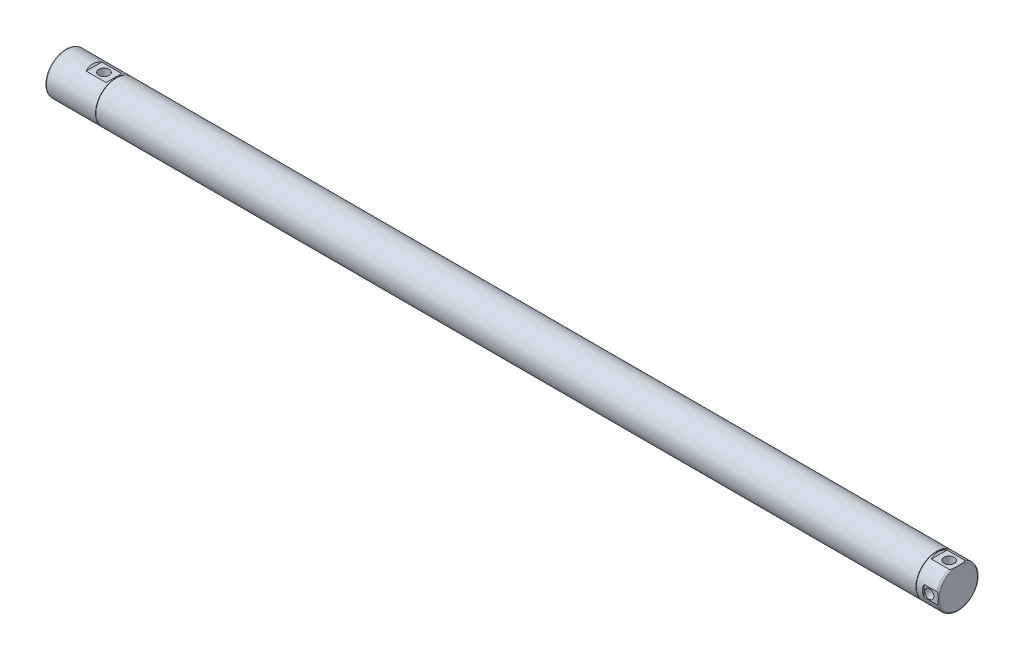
ISO-10303-21;
HEADER;
FILE_DESCRIPTION(('STEP AP214'),'2;1');
FILE_NAME('part.step','',(''),(''),'','','');
FILE_SCHEMA(('AUTOMOTIVE_DESIGN { 1 0 10303 214 1 1 1 1 }'));
ENDSEC;
DATA;
#1=APPLICATION_CONTEXT('core data for automotive mechanical design processes');
#2=APPLICATION_PROTOCOL_DEFINITION('international standard','automotive_design',2000,#1);
#3=PRODUCT_CONTEXT('',#1,'mechanical');
#4=PRODUCT('Part','Part','',(#3));
#5=PRODUCT_RELATED_PRODUCT_CATEGORY('part','',(#4));
#6=PRODUCT_DEFINITION_FORMATION('','',#4);
#7=PRODUCT_DEFINITION_CONTEXT('part definition',#1,'design');
#8=PRODUCT_DEFINITION('design','',#6,#7);
#9=PRODUCT_DEFINITION_SHAPE('','',#8);
#10=(LENGTH_UNIT() NAMED_UNIT(*) SI_UNIT(.MILLI.,.METRE.));
#11=(NAMED_UNIT(*) PLANE_ANGLE_UNIT() SI_UNIT($,.RADIAN.));
#12=(NAMED_UNIT(*) SI_UNIT($,.STERADIAN.) SOLID_ANGLE_UNIT());
#13=UNCERTAINTY_MEASURE_WITH_UNIT(LENGTH_MEASURE(1.E-05),#10,'distance_accuracy_value','');
#14=(GEOMETRIC_REPRESENTATION_CONTEXT(3) GLOBAL_UNCERTAINTY_ASSIGNED_CONTEXT((#13)) GLOBAL_UNIT_ASSIGNED_CONTEXT((#10,
#11,#12)) REPRESENTATION_CONTEXT('',''));
#15=CARTESIAN_POINT('',(0.,0.,0.));
#16=DIRECTION('',(0.,0.,1.));
#17=DIRECTION('',(1.,0.,0.));
#18=AXIS2_PLACEMENT_3D('',#15,#16,#17);
#19=CARTESIAN_POINT('',(546.,-27.,-26.));
#20=DIRECTION('',(0.,0.,1.));
#21=DIRECTION('',(1.,0.,0.));
#22=AXIS2_PLACEMENT_3D('',#19,#20,#21);
#23=PLANE('',#22);
#24=DIRECTION('',(1.,0.,0.));
#25=VECTOR('',#24,1.);
#26=CARTESIAN_POINT('',(-603.,-7.2801098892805,-26.));
#27=LINE('',#26,#25);
#28=CARTESIAN_POINT('',(563.,-7.28010988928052,-26.));
#29=VERTEX_POINT('',#28);
#30=CARTESIAN_POINT('',(546.,-7.2801098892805,-26.));
#31=VERTEX_POINT('',#30);
#32=EDGE_CURVE('E128',#29,#31,#27,.F.);
#33=ORIENTED_EDGE('',*,*,#32,.T.);
#34=DIRECTION('',(0.,1.,0.));
#35=VECTOR('',#34,1.);
#36=CARTESIAN_POINT('',(546.,-27.,-26.));
#37=LINE('',#36,#35);
#38=CARTESIAN_POINT('',(546.,7.2801098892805,-26.));
#39=VERTEX_POINT('',#38);
#40=EDGE_CURVE('E125',#31,#39,#37,.T.);
#41=ORIENTED_EDGE('',*,*,#40,.T.);
#42=DIRECTION('',(1.,0.,0.));
#43=VECTOR('',#42,1.);
#44=CARTESIAN_POINT('',(-603.,7.2801098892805,-26.));
#45=LINE('',#44,#43);
#46=CARTESIAN_POINT('',(563.,7.2801098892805,-26.));
#47=VERTEX_POINT('',#46);
#48=EDGE_CURVE('E31',#39,#47,#45,.T.);
#49=ORIENTED_EDGE('',*,*,#48,.T.);
#50=CARTESIAN_POINT('',(564.719897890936,-1.03921017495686,-26.));
#51=CARTESIAN_POINT('',(564.711968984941,-1.37385087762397,-26.));
#52=CARTESIAN_POINT('',(564.700048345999,-1.70840081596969,-26.));
#53=CARTESIAN_POINT('',(564.66644832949,-2.37720382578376,-26.));
#54=CARTESIAN_POINT('',(564.644764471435,-2.71145669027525,-26.));
#55=CARTESIAN_POINT('',(564.602339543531,-3.21182176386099,-26.));
#56=CARTESIAN_POINT('',(564.586558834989,-3.37835461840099,-26.));
#57=CARTESIAN_POINT('',(564.551031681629,-3.71099274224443,-26.));
#58=CARTESIAN_POINT('',(564.531285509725,-3.87709804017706,-26.));
#59=CARTESIAN_POINT('',(564.486997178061,-4.20853649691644,-26.));
#60=CARTESIAN_POINT('',(564.462458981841,-4.37387017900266,-26.));
#61=CARTESIAN_POINT('',(564.40742411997,-4.70353106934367,-26.));
#62=CARTESIAN_POINT('',(564.37692870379,-4.86785848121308,-26.));
#63=CARTESIAN_POINT('',(564.317556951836,-5.15087901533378,-26.));
#64=CARTESIAN_POINT('',(564.290456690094,-5.26994260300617,-26.));
#65=CARTESIAN_POINT('',(564.231251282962,-5.50690330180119,-26.));
#66=CARTESIAN_POINT('',(564.199143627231,-5.62479979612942,-26.));
#67=CARTESIAN_POINT('',(564.128582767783,-5.8589619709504,-26.));
#68=CARTESIAN_POINT('',(564.090116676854,-5.97522380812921,-26.));
#69=CARTESIAN_POINT('',(564.005028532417,-6.2046877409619,-26.));
#70=CARTESIAN_POINT('',(563.958415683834,-6.31789312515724,-26.));
#71=CARTESIAN_POINT('',(563.879762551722,-6.48440310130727,-26.));
#72=CARTESIAN_POINT('',(563.851897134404,-6.53967497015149,-26.));
#73=CARTESIAN_POINT('',(563.792690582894,-6.64831071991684,-26.));
#74=CARTESIAN_POINT('',(563.761351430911,-6.70167566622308,-26.));
#75=CARTESIAN_POINT('',(563.69461277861,-6.8054019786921,-26.));
#76=CARTESIAN_POINT('',(563.659237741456,-6.8557788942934,-26.));
#77=CARTESIAN_POINT('',(563.583334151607,-6.95243176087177,-26.));
#78=CARTESIAN_POINT('',(563.542817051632,-6.99871644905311,-26.));
#79=CARTESIAN_POINT('',(563.464821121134,-7.07560031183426,-26.));
#80=CARTESIAN_POINT('',(563.428571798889,-7.10742946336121,-26.));
#81=CARTESIAN_POINT('',(563.351638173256,-7.16521551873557,-26.));
#82=CARTESIAN_POINT('',(563.310965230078,-7.19118696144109,-26.));
#83=CARTESIAN_POINT('',(563.238383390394,-7.22791197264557,-26.));
#84=CARTESIAN_POINT('',(563.207611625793,-7.24088989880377,-26.));
#85=CARTESIAN_POINT('',(563.144358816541,-7.2616811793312,-26.));
#86=CARTESIAN_POINT('',(563.111879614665,-7.26949998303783,-26.));
#87=CARTESIAN_POINT('',(563.045800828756,-7.27918474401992,-26.));
#88=CARTESIAN_POINT('',(563.012195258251,-7.28101101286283,-26.));
#89=CARTESIAN_POINT('',(562.945232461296,-7.27836851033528,-26.));
#90=CARTESIAN_POINT('',(562.911875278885,-7.27389864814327,-26.));
#91=CARTESIAN_POINT('',(562.849255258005,-7.25982649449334,-26.));
#92=CARTESIAN_POINT('',(562.819884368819,-7.25068882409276,-26.));
#93=CARTESIAN_POINT('',(562.762753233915,-7.22834628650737,-26.));
#94=CARTESIAN_POINT('',(562.734993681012,-7.21513968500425,-26.));
#95=CARTESIAN_POINT('',(562.662996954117,-7.17535141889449,-26.));
#96=CARTESIAN_POINT('',(562.620416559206,-7.14578696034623,-26.));
#97=CARTESIAN_POINT('',(562.540194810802,-7.08056565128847,-26.));
#98=CARTESIAN_POINT('',(562.502570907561,-7.04488824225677,-26.));
#99=CARTESIAN_POINT('',(562.433345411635,-6.97134092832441,-26.));
#100=CARTESIAN_POINT('',(562.401541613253,-6.93365804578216,-26.));
#101=CARTESIAN_POINT('',(562.341210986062,-6.85573079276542,-26.));
#102=CARTESIAN_POINT('',(562.312687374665,-6.8154839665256,-26.));
#103=CARTESIAN_POINT('',(562.258377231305,-6.73310025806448,-26.));
#104=CARTESIAN_POINT('',(562.232595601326,-6.69096017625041,-26.));
#105=CARTESIAN_POINT('',(562.183417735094,-6.60534629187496,-26.));
#106=CARTESIAN_POINT('',(562.160020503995,-6.56187305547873,-26.));
#107=CARTESIAN_POINT('',(562.10194393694,-6.44774626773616,-26.));
#108=CARTESIAN_POINT('',(562.068826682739,-6.37629878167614,-26.));
#109=CARTESIAN_POINT('',(562.006716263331,-6.23162028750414,-26.));
#110=CARTESIAN_POINT('',(561.977725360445,-6.15838832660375,-26.));
#111=CARTESIAN_POINT('',(561.8957155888,-5.93657210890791,-26.));
#112=CARTESIAN_POINT('',(561.847776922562,-5.78611326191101,-26.));
#113=CARTESIAN_POINT('',(561.761281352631,-5.48157352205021,-26.));
#114=CARTESIAN_POINT('',(561.722787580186,-5.32747542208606,-26.));
#115=CARTESIAN_POINT('',(561.670648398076,-5.09519858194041,-26.));
#116=CARTESIAN_POINT('',(561.654210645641,-5.01763276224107,-26.));
#117=CARTESIAN_POINT('',(561.622982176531,-4.86217343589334,-26.));
#118=CARTESIAN_POINT('',(561.608191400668,-4.78427994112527,-26.));
#119=CARTESIAN_POINT('',(561.562558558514,-4.53110448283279,-26.));
#120=CARTESIAN_POINT('',(561.534654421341,-4.35529081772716,-26.));
#121=CARTESIAN_POINT('',(561.484605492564,-4.00283672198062,-26.));
#122=CARTESIAN_POINT('',(561.462461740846,-3.82619614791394,-26.));
#123=CARTESIAN_POINT('',(561.422823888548,-3.47228064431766,-26.));
#124=CARTESIAN_POINT('',(561.405332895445,-3.29500537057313,-26.));
#125=CARTESIAN_POINT('',(561.374212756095,-2.94013183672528,-26.));
#126=CARTESIAN_POINT('',(561.360583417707,-2.76253359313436,-26.));
#127=CARTESIAN_POINT('',(561.324463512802,-2.22835247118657,-26.));
#128=CARTESIAN_POINT('',(561.30685115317,-1.87143938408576,-26.));
#129=CARTESIAN_POINT('',(561.281444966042,-1.15726177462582,-26.));
#130=CARTESIAN_POINT('',(561.2736520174,-0.799997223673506,-26.));
#131=CARTESIAN_POINT('',(561.268374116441,-0.264496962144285,-26.));
#132=CARTESIAN_POINT('',(561.267680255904,-0.0862874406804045,-26.));
#133=CARTESIAN_POINT('',(561.268405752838,0.270118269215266,-26.));
#134=CARTESIAN_POINT('',(561.269824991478,0.448314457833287,-26.));
#135=CARTESIAN_POINT('',(561.274832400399,0.804721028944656,-26.));
#136=CARTESIAN_POINT('',(561.278421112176,0.982931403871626,-26.));
#137=CARTESIAN_POINT('',(561.287921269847,1.33929331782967,-26.));
#138=CARTESIAN_POINT('',(561.293832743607,1.51744485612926,-26.));
#139=CARTESIAN_POINT('',(561.308211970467,1.87321095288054,-26.));
#140=CARTESIAN_POINT('',(561.316673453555,2.05082576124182,-26.));
#141=CARTESIAN_POINT('',(561.336519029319,2.40589140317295,-26.));
#142=CARTESIAN_POINT('',(561.347903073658,2.58334223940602,-26.));
#143=CARTESIAN_POINT('',(561.374084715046,2.93794048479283,-26.));
#144=CARTESIAN_POINT('',(561.388881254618,3.11508797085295,-26.));
#145=CARTESIAN_POINT('',(561.422552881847,3.4689898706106,-26.));
#146=CARTESIAN_POINT('',(561.441427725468,3.64574430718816,-26.));
#147=CARTESIAN_POINT('',(561.48394485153,3.9969782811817,-26.));
#148=CARTESIAN_POINT('',(561.507539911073,4.17146342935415,-26.));
#149=CARTESIAN_POINT('',(561.560812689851,4.51961759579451,-26.));
#150=CARTESIAN_POINT('',(561.590493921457,4.6932860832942,-26.));
#151=CARTESIAN_POINT('',(561.657634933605,5.03932382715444,-26.));
#152=CARTESIAN_POINT('',(561.695101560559,5.21169180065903,-26.));
#153=CARTESIAN_POINT('',(561.759038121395,5.4682514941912,-26.));
#154=CARTESIAN_POINT('',(561.781630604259,5.55341026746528,-26.));
#155=CARTESIAN_POINT('',(561.829866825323,5.7228543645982,-26.));
#156=CARTESIAN_POINT('',(561.855510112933,5.80713981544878,-26.));
#157=CARTESIAN_POINT('',(561.910689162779,5.97527763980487,-26.));
#158=CARTESIAN_POINT('',(561.940257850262,6.05911930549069,-26.));
#159=CARTESIAN_POINT('',(562.00396784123,6.22515472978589,-26.));
#160=CARTESIAN_POINT('',(562.038113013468,6.30734702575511,-26.));
#161=CARTESIAN_POINT('',(562.111962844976,6.46878111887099,-26.));
#162=CARTESIAN_POINT('',(562.151641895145,6.54803449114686,-26.));
#163=CARTESIAN_POINT('',(562.238307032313,6.70237997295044,-26.));
#164=CARTESIAN_POINT('',(562.285278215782,6.77748015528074,-26.));
#165=CARTESIAN_POINT('',(562.374939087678,6.90110109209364,-26.));
#166=CARTESIAN_POINT('',(562.415305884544,6.95128694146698,-26.));
#167=CARTESIAN_POINT('',(562.50258005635,7.04563465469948,-26.));
#168=CARTESIAN_POINT('',(562.54946784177,7.08981380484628,-26.));
#169=CARTESIAN_POINT('',(562.630417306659,7.15224507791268,-26.));
#170=CARTESIAN_POINT('',(562.661954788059,7.17374015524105,-26.));
#171=CARTESIAN_POINT('',(562.727863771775,7.21188693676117,-26.));
#172=CARTESIAN_POINT('',(562.762231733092,7.2285445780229,-26.));
#173=CARTESIAN_POINT('',(562.827695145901,7.25333191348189,-26.));
#174=CARTESIAN_POINT('',(562.858429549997,7.26240163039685,-26.));
#175=CARTESIAN_POINT('',(562.920985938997,7.2752274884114,-26.));
#176=CARTESIAN_POINT('',(562.952806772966,7.278989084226,-26.));
#177=CARTESIAN_POINT('',(563.01669342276,7.28079943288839,-26.));
#178=CARTESIAN_POINT('',(563.048759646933,7.2788342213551,-26.));
#179=CARTESIAN_POINT('',(563.112069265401,7.26938488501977,-26.));
#180=CARTESIAN_POINT('',(563.143311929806,7.26189602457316,-26.));
#181=CARTESIAN_POINT('',(563.211663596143,7.23970897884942,-26.));
#182=CARTESIAN_POINT('',(563.248340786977,7.2236963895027,-26.));
#183=CARTESIAN_POINT('',(563.318646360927,7.18601233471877,-26.));
#184=CARTESIAN_POINT('',(563.352268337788,7.16432933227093,-26.));
#185=CARTESIAN_POINT('',(563.436771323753,7.10185843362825,-26.));
#186=CARTESIAN_POINT('',(563.485104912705,7.05766542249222,-26.));
#187=CARTESIAN_POINT('',(563.574916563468,6.96285985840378,-26.));
#188=CARTESIAN_POINT('',(563.616375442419,6.91223001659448,-26.));
#189=CARTESIAN_POINT('',(563.705883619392,6.79060030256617,-26.));
#190=CARTESIAN_POINT('',(563.751961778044,6.71816859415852,-26.));
#191=CARTESIAN_POINT('',(563.837120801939,6.56924703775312,-26.));
#192=CARTESIAN_POINT('',(563.876187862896,6.49274956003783,-26.));
#193=CARTESIAN_POINT('',(563.949031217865,6.33682553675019,-26.));
#194=CARTESIAN_POINT('',(563.982779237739,6.25738593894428,-26.));
#195=CARTESIAN_POINT('',(564.045824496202,6.09687120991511,-26.));
#196=CARTESIAN_POINT('',(564.075125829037,6.01579766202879,-26.));
#197=CARTESIAN_POINT('',(564.150277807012,5.79265602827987,-26.));
#198=CARTESIAN_POINT('',(564.192540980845,5.64938374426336,-26.));
#199=CARTESIAN_POINT('',(564.269113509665,5.36070211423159,-26.));
#200=CARTESIAN_POINT('',(564.303417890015,5.21529149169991,-26.));
#201=CARTESIAN_POINT('',(564.365876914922,4.92285359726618,-26.));
#202=CARTESIAN_POINT('',(564.394018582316,4.77582358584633,-26.));
#203=CARTESIAN_POINT('',(564.445309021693,4.48088567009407,-26.));
#204=CARTESIAN_POINT('',(564.468457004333,4.33297763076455,-26.));
#205=CARTESIAN_POINT('',(564.510676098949,4.036451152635,-26.));
#206=CARTESIAN_POINT('',(564.529743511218,3.88783219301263,-26.));
#207=CARTESIAN_POINT('',(564.564450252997,3.59019132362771,-26.));
#208=CARTESIAN_POINT('',(564.580089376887,3.44116939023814,-26.));
#209=CARTESIAN_POINT('',(564.622642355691,2.99406883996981,-26.));
#210=CARTESIAN_POINT('',(564.64524240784,2.69557888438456,-26.));
#211=CARTESIAN_POINT('',(564.681054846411,2.11081272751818,-26.));
#212=CARTESIAN_POINT('',(564.694625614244,1.82455698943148,-26.));
#213=CARTESIAN_POINT('',(564.715369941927,1.25173044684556,-26.));
#214=CARTESIAN_POINT('',(564.72254154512,0.965159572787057,-26.));
#215=CARTESIAN_POINT('',(564.731272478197,0.392243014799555,-26.));
#216=CARTESIAN_POINT('',(564.73283780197,0.105897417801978,-26.));
#217=CARTESIAN_POINT('',(564.730540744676,-0.466724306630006,-26.));
#218=CARTESIAN_POINT('',(564.726679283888,-0.753000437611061,-26.));
#219=CARTESIAN_POINT('',(564.719897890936,-1.03921017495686,-26.));
#220=B_SPLINE_CURVE_WITH_KNOTS('',3,(#50,#51,#52,#53,#54,#55,#56,#57,#58,#59,#60,#61,#62,#63,
#64,#65,#66,#67,#68,#69,#70,#71,#72,#73,#74,#75,#76,#77,#78,#79,#80,#81,#82,#83,#84,#85,#86,#87,
#88,#89,#90,#91,#92,#93,#94,#95,#96,#97,#98,#99,#100,#101,#102,#103,#104,#105,#106,#107,#108,
#109,#110,#111,#112,#113,#114,#115,#116,#117,#118,#119,#120,#121,#122,#123,#124,#125,#126,#127,
#128,#129,#130,#131,#132,#133,#134,#135,#136,#137,#138,#139,#140,#141,#142,#143,#144,#145,#146,
#147,#148,#149,#150,#151,#152,#153,#154,#155,#156,#157,#158,#159,#160,#161,#162,#163,#164,#165,
#166,#167,#168,#169,#170,#171,#172,#173,#174,#175,#176,#177,#178,#179,#180,#181,#182,#183,#184,
#185,#186,#187,#188,#189,#190,#191,#192,#193,#194,#195,#196,#197,#198,#199,#200,#201,#202,#203,
#204,#205,#206,#207,#208,#209,#210,#211,#212,#213,#214,#215,#216,#217,#218,#219),.UNSPECIFIED.,
.T.,.F.,(4,2,2,2,2,2,2,2,2,2,2,2,2,2,2,2,2,2,2,2,2,2,2,2,2,2,2,2,2,2,2,2,2,2,2,2,2,2,2,2,2,2,2,
2,2,2,2,2,2,2,2,2,2,2,2,2,2,2,2,2,2,2,2,2,2,2,2,2,2,2,2,2,2,2,2,2,2,2,2,2,2,2,2,2,4),(0.,
1.00418423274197,2.00882977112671,2.51063014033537,3.01239598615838,3.51374855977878,
4.01499609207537,4.38124111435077,4.74767033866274,5.11485155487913,5.48162054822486,
5.66722313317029,5.85272034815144,6.03714759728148,6.22117105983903,6.36550391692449,
6.50947449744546,6.60929669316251,6.70901328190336,6.8093889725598,6.90978205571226,
7.00170872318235,7.09367462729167,7.24828759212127,7.40343112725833,7.55113932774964,
7.69899119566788,7.84710309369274,7.9951529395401,8.23121845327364,8.46741289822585,
8.94061513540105,9.4168990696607,9.65474850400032,9.89258938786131,10.4264930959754,
10.9604931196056,11.4948488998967,12.0291780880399,13.1010200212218,14.1729578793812,
14.7075801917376,15.2421724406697,15.7768981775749,16.3116303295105,16.8450582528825,
17.3784773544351,17.9117313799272,18.4449535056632,18.973086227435,19.501524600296,
20.0304296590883,20.2946996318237,20.5589306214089,20.8255373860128,21.0923709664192,
21.3580083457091,21.6231097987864,21.8159500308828,22.008222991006,22.1224117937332,
22.2364598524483,22.3321891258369,22.4278199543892,22.5236841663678,22.6196306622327,
22.7390201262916,22.8586544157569,23.054019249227,23.2499203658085,23.506856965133,
23.7642940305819,24.023056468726,24.281579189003,24.729352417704,25.1774047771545,
25.6263917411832,26.0754496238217,26.5249129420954,26.9744032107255,27.8722447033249,
28.7319006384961,29.5918193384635,30.4508183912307,31.3096717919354),.UNSPECIFIED.);
#221=EDGE_CURVE('E24',#47,#29,#220,.T.);
#222=ORIENTED_EDGE('',*,*,#221,.T.);
#223=EDGE_LOOP('',(#33,#41,#49,#222));
#224=FACE_BOUND('',#223,.T.);
#225=CARTESIAN_POINT('',(553.,0.,-26.));
#226=DIRECTION('',(0.,0.,-1.));
#227=DIRECTION('',(-1.,0.,0.));
#228=AXIS2_PLACEMENT_3D('',#225,#226,#227);
#229=CIRCLE('',#228,6.00000000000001);
#230=CARTESIAN_POINT('',(547.,0.,-26.));
#231=VERTEX_POINT('',#230);
#232=EDGE_CURVE('E110',#231,#231,#229,.T.);
#233=ORIENTED_EDGE('',*,*,#232,.F.);
#234=EDGE_LOOP('',(#233));
#235=FACE_BOUND('',#234,.T.);
#236=ADVANCED_FACE('F16',(#224,#235),#23,.F.);
#237=CARTESIAN_POINT('',(-603.,0.,0.));
#238=DIRECTION('',(1.,0.,0.));
#239=DIRECTION('',(0.,0.,-1.));
#240=AXIS2_PLACEMENT_3D('',#237,#238,#239);
#241=CYLINDRICAL_SURFACE('',#240,27.);
#242=DIRECTION('',(1.,0.,0.));
#243=VECTOR('',#242,1.);
#244=CARTESIAN_POINT('',(-603.,25.,-10.1980390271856));
#245=LINE('',#244,#243);
#246=CARTESIAN_POINT('',(-540.,25.,-10.1980390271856));
#247=VERTEX_POINT('',#246);
#248=CARTESIAN_POINT('',(-566.,25.,-10.1980390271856));
#249=VERTEX_POINT('',#248);
#250=EDGE_CURVE('E229',#247,#249,#245,.F.);
#251=ORIENTED_EDGE('',*,*,#250,.F.);
#252=CARTESIAN_POINT('',(-564.999999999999,0.,0.));
#253=DIRECTION('',(0.707106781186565,-0.70710678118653,0.));
#254=DIRECTION('',(0.70710678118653,0.707106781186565,0.));
#255=AXIS2_PLACEMENT_3D('',#252,#253,#254);
#256=ELLIPSE('',#255,38.1837661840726,27.);
#257=CARTESIAN_POINT('',(-540.,25.,10.1980390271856));
#258=VERTEX_POINT('',#257);
#259=EDGE_CURVE('E232',#258,#247,#256,.F.);
#260=ORIENTED_EDGE('',*,*,#259,.F.);
#261=DIRECTION('',(1.,0.,0.));
#262=VECTOR('',#261,1.);
#263=CARTESIAN_POINT('',(-603.,25.,10.1980390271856));
#264=LINE('',#263,#262);
#265=CARTESIAN_POINT('',(-566.,25.,10.1980390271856));
#266=VERTEX_POINT('',#265);
#267=EDGE_CURVE('E227',#266,#258,#264,.T.);
#268=ORIENTED_EDGE('',*,*,#267,.F.);
#269=CARTESIAN_POINT('',(-541.000000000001,0.,0.));
#270=DIRECTION('',(-0.707106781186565,-0.70710678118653,0.));
#271=DIRECTION('',(0.70710678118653,-0.707106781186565,0.));
#272=AXIS2_PLACEMENT_3D('',#269,#270,#271);
#273=ELLIPSE('',#272,38.1837661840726,27.);
#274=EDGE_CURVE('E225',#249,#266,#273,.F.);
#275=ORIENTED_EDGE('',*,*,#274,.F.);
#276=EDGE_LOOP('',(#251,#260,#268,#275));
#277=FACE_BOUND('',#276,.T.);
#278=CARTESIAN_POINT('',(-601.,0.,0.));
#279=DIRECTION('',(1.,0.,0.));
#280=DIRECTION('',(0.,0.,-1.));
#281=AXIS2_PLACEMENT_3D('',#278,#279,#280);
#282=CIRCLE('',#281,27.);
#283=CARTESIAN_POINT('',(-601.,0.,-27.));
#284=VERTEX_POINT('',#283);
#285=EDGE_CURVE('E219',#284,#284,#282,.T.);
#286=ORIENTED_EDGE('',*,*,#285,.T.);
#287=EDGE_LOOP('',(#286));
#288=FACE_BOUND('',#287,.T.);
#289=CARTESIAN_POINT('',(-537.,0.,0.));
#290=DIRECTION('',(1.,0.,0.));
#291=DIRECTION('',(0.,0.,-1.));
#292=AXIS2_PLACEMENT_3D('',#289,#290,#291);
#293=CIRCLE('',#292,27.);
#294=CARTESIAN_POINT('',(-537.,0.,-27.));
#295=VERTEX_POINT('',#294);
#296=EDGE_CURVE('E191',#295,#295,#293,.T.);
#297=ORIENTED_EDGE('',*,*,#296,.F.);
#298=EDGE_LOOP('',(#297));
#299=FACE_BOUND('',#298,.T.);
#300=ADVANCED_FACE('F351',(#277,#288,#299),#241,.T.);
#301=CARTESIAN_POINT('',(536.5,0.,0.));
#302=DIRECTION('',(1.,0.,0.));
#303=DIRECTION('',(0.,0.,-1.));
#304=AXIS2_PLACEMENT_3D('',#301,#302,#303);
#305=CIRCLE('',#304,27.);
#306=CARTESIAN_POINT('',(536.5,0.,-27.));
#307=VERTEX_POINT('',#306);
#308=EDGE_CURVE('E179',#307,#307,#305,.T.);
#309=ORIENTED_EDGE('',*,*,#308,.F.);
#310=EDGE_LOOP('',(#309));
#311=FACE_BOUND('',#310,.T.);
#312=CARTESIAN_POINT('',(-536.5,0.,0.));
#313=DIRECTION('',(1.,0.,0.));
#314=DIRECTION('',(0.,0.,-1.));
#315=AXIS2_PLACEMENT_3D('',#312,#313,#314);
#316=CIRCLE('',#315,27.);
#317=CARTESIAN_POINT('',(-536.5,0.,-27.));
#318=VERTEX_POINT('',#317);
#319=EDGE_CURVE('E194',#318,#318,#316,.T.);
#320=ORIENTED_EDGE('',*,*,#319,.T.);
#321=EDGE_LOOP('',(#320));
#322=FACE_BOUND('',#321,.T.);
#323=ADVANCED_FACE('F357',(#311,#322),#241,.T.);
#324=CARTESIAN_POINT('',(-603.,0.,0.));
#325=DIRECTION('',(1.,0.,0.));
#326=DIRECTION('',(0.,0.,-1.));
#327=AXIS2_PLACEMENT_3D('',#324,#325,#326);
#328=PLANE('',#327);
#329=CARTESIAN_POINT('',(-603.,0.,0.));
#330=DIRECTION('',(1.,0.,0.));
#331=DIRECTION('',(0.,0.,-1.));
#332=AXIS2_PLACEMENT_3D('',#329,#330,#331);
#333=CIRCLE('',#332,25.);
#334=CARTESIAN_POINT('',(-603.,0.,-25.));
#335=VERTEX_POINT('',#334);
#336=EDGE_CURVE('E222',#335,#335,#333,.F.);
#337=ORIENTED_EDGE('',*,*,#336,.T.);
#338=EDGE_LOOP('',(#337));
#339=FACE_BOUND('',#338,.T.);
#340=CARTESIAN_POINT('',(-603.,0.,0.));
#341=DIRECTION('',(1.,0.,0.));
#342=DIRECTION('',(0.,0.,-1.));
#343=AXIS2_PLACEMENT_3D('',#340,#341,#342);
#344=CIRCLE('',#343,10.);
#345=CARTESIAN_POINT('',(-603.,0.,-10.));
#346=VERTEX_POINT('',#345);
#347=EDGE_CURVE('E204',#346,#346,#344,.T.);
#348=ORIENTED_EDGE('',*,*,#347,.T.);
#349=EDGE_LOOP('',(#348));
#350=FACE_BOUND('',#349,.T.);
#351=ADVANCED_FACE('F312',(#339,#350),#328,.F.);
#352=CARTESIAN_POINT('',(-537.,0.,0.));
#353=DIRECTION('',(1.,0.,0.));
#354=DIRECTION('',(0.,0.,-1.));
#355=AXIS2_PLACEMENT_3D('',#352,#353,#354);
#356=PLANE('',#355);
#357=CARTESIAN_POINT('',(-537.,0.,0.));
#358=DIRECTION('',(1.,0.,0.));
#359=DIRECTION('',(0.,0.,-1.));
#360=AXIS2_PLACEMENT_3D('',#357,#358,#359);
#361=CIRCLE('',#360,25.);
#362=CARTESIAN_POINT('',(-537.,0.,-25.));
#363=VERTEX_POINT('',#362);
#364=EDGE_CURVE('E207',#363,#363,#361,.F.);
#365=ORIENTED_EDGE('',*,*,#364,.F.);
#366=EDGE_LOOP('',(#365));
#367=FACE_BOUND('',#366,.T.);
#368=CARTESIAN_POINT('',(-537.,0.,0.));
#369=DIRECTION('',(1.,0.,0.));
#370=DIRECTION('',(0.,0.,-1.));
#371=AXIS2_PLACEMENT_3D('',#368,#369,#370);
#372=CIRCLE('',#371,10.);
#373=CARTESIAN_POINT('',(-537.,0.,-10.));
#374=VERTEX_POINT('',#373);
#375=EDGE_CURVE('E203',#374,#374,#372,.T.);
#376=ORIENTED_EDGE('',*,*,#375,.F.);
#377=EDGE_LOOP('',(#376));
#378=FACE_BOUND('',#377,.T.);
#379=ADVANCED_FACE('F310',(#367,#378),#356,.T.);
#380=CARTESIAN_POINT('',(-603.,0.,0.));
#381=DIRECTION('',(1.,0.,0.));
#382=DIRECTION('',(0.,0.,-1.));
#383=AXIS2_PLACEMENT_3D('',#380,#381,#382);
#384=CYLINDRICAL_SURFACE('',#383,10.);
#385=CARTESIAN_POINT('',(-553.,8.31008310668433,5.56259999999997));
#386=CARTESIAN_POINT('',(-552.857713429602,8.31008042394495,5.56260192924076));
#387=CARTESIAN_POINT('',(-552.715447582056,8.31374922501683,5.55713426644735));
#388=CARTESIAN_POINT('',(-552.432070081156,8.32826541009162,5.53535638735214));
#389=CARTESIAN_POINT('',(-552.290958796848,8.33911500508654,5.51904283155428));
#390=CARTESIAN_POINT('',(-552.010903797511,8.367578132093,5.47579252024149));
#391=CARTESIAN_POINT('',(-551.871962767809,8.38519944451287,5.44884354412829));
#392=CARTESIAN_POINT('',(-551.597366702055,8.42652914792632,5.38470535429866));
#393=CARTESIAN_POINT('',(-551.461713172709,8.45024027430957,5.34751153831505));
#394=CARTESIAN_POINT('',(-551.062812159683,8.52893407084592,5.22178789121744));
#395=CARTESIAN_POINT('',(-550.805511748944,8.59171268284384,5.11878044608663));
#396=CARTESIAN_POINT('',(-550.312093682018,8.73074965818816,4.87783390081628));
#397=CARTESIAN_POINT('',(-550.075980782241,8.80701103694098,4.73988698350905));
#398=CARTESIAN_POINT('',(-549.604569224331,8.97401547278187,4.41628126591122));
#399=CARTESIAN_POINT('',(-549.371887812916,9.06544035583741,4.22716059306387));
#400=CARTESIAN_POINT('',(-548.939356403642,9.24703873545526,3.81355513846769));
#401=CARTESIAN_POINT('',(-548.739526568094,9.33721143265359,3.58904880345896));
#402=CARTESIAN_POINT('',(-548.459828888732,9.46906131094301,3.21811080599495));
#403=CARTESIAN_POINT('',(-548.366756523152,9.51413138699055,3.08265074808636));
#404=CARTESIAN_POINT('',(-548.192480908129,9.60020676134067,2.80310130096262));
#405=CARTESIAN_POINT('',(-548.111272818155,9.6412137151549,2.6590154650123));
#406=CARTESIAN_POINT('',(-547.961575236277,9.71797714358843,2.36310851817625));
#407=CARTESIAN_POINT('',(-547.893081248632,9.75373547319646,2.21129016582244));
#408=CARTESIAN_POINT('',(-547.769625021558,9.8189385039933,1.90093956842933));
#409=CARTESIAN_POINT('',(-547.714660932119,9.84838406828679,1.7424082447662));
#410=CARTESIAN_POINT('',(-547.623101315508,9.89783650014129,1.43358971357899));
#411=CARTESIAN_POINT('',(-547.585344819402,9.91843131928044,1.28374045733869));
#412=CARTESIAN_POINT('',(-547.522343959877,9.95296442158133,0.98068691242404));
#413=CARTESIAN_POINT('',(-547.497098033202,9.96690353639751,0.827483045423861));
#414=CARTESIAN_POINT('',(-547.459499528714,9.98771152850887,0.519119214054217));
#415=CARTESIAN_POINT('',(-547.447139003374,9.99458476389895,0.363960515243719));
#416=CARTESIAN_POINT('',(-547.435477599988,10.0010682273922,0.0530064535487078));
#417=CARTESIAN_POINT('',(-547.436175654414,10.0006790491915,-0.102788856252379));
#418=CARTESIAN_POINT('',(-547.449838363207,9.99308517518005,-0.396878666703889));
#419=CARTESIAN_POINT('',(-547.461477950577,9.98661672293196,-0.535256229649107));
#420=CARTESIAN_POINT('',(-547.495007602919,9.96806033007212,-0.81042713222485));
#421=CARTESIAN_POINT('',(-547.516900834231,9.95597065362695,-0.947219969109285));
#422=CARTESIAN_POINT('',(-547.570671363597,9.92645891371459,-1.21818865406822));
#423=CARTESIAN_POINT('',(-547.602545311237,9.90903863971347,-1.35236536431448));
#424=CARTESIAN_POINT('',(-547.675940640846,9.86925219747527,-1.61735037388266));
#425=CARTESIAN_POINT('',(-547.717465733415,9.84688412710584,-1.74815735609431));
#426=CARTESIAN_POINT('',(-547.810197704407,9.79744731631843,-2.00687176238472));
#427=CARTESIAN_POINT('',(-547.861495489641,9.77033465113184,-2.13473819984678));
#428=CARTESIAN_POINT('',(-547.973037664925,9.71213544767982,-2.38558909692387));
#429=CARTESIAN_POINT('',(-548.033285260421,9.68104748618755,-2.50857178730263));
#430=CARTESIAN_POINT('',(-548.226732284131,9.58275385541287,-2.86928315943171));
#431=CARTESIAN_POINT('',(-548.372695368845,9.51048586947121,-3.09893920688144));
#432=CARTESIAN_POINT('',(-548.712424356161,9.34965109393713,-3.55657669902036));
#433=CARTESIAN_POINT('',(-548.909673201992,9.26016613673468,-3.78162550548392));
#434=CARTESIAN_POINT('',(-549.337479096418,9.07931511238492,-4.19731098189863));
#435=CARTESIAN_POINT('',(-549.568071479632,8.98794713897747,-4.38791065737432));
#436=CARTESIAN_POINT('',(-549.946982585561,8.85227728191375,-4.65277187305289));
#437=CARTESIAN_POINT('',(-550.085127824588,8.80543893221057,-4.74056664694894));
#438=CARTESIAN_POINT('',(-550.369599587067,8.71540502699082,-4.90412240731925));
#439=CARTESIAN_POINT('',(-550.515927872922,8.67221026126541,-4.97988078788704));
#440=CARTESIAN_POINT('',(-550.815841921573,8.59111207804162,-5.11852016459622));
#441=CARTESIAN_POINT('',(-550.969422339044,8.55320484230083,-5.18141046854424));
#442=CARTESIAN_POINT('',(-551.282885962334,8.48425735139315,-5.29355406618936));
#443=CARTESIAN_POINT('',(-551.442764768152,8.45321239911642,-5.34281669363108));
#444=CARTESIAN_POINT('',(-551.754627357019,8.40159021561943,-5.42359609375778));
#445=CARTESIAN_POINT('',(-551.906218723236,8.38037400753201,-5.45621769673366));
#446=CARTESIAN_POINT('',(-552.212490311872,8.34592805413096,-5.5087638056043));
#447=CARTESIAN_POINT('',(-552.367170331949,8.33269778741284,-5.52868914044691));
#448=CARTESIAN_POINT('',(-552.677995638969,8.31487359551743,-5.55546021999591));
#449=CARTESIAN_POINT('',(-552.834139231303,8.31027068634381,-5.56231957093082));
#450=CARTESIAN_POINT('',(-553.146448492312,8.30990686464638,-5.56286349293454));
#451=CARTESIAN_POINT('',(-553.302614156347,8.31414493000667,-5.55654958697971));
#452=CARTESIAN_POINT('',(-553.589937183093,8.32995405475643,-5.53281368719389));
#453=CARTESIAN_POINT('',(-553.721315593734,8.34032335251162,-5.51720972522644));
#454=CARTESIAN_POINT('',(-553.982068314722,8.36690387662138,-5.47681402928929));
#455=CARTESIAN_POINT('',(-554.111441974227,8.38311696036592,-5.45201937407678));
#456=CARTESIAN_POINT('',(-554.495304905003,8.43976257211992,-5.36426604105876));
#457=CARTESIAN_POINT('',(-554.745688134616,8.48821078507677,-5.2879250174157));
#458=CARTESIAN_POINT('',(-555.239982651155,8.60317239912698,-5.09882765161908));
#459=CARTESIAN_POINT('',(-555.483204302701,8.67034679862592,-4.98470282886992));
#460=CARTESIAN_POINT('',(-555.94854420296,8.81489888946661,-4.72437453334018));
#461=CARTESIAN_POINT('',(-556.170652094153,8.8922815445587,-4.57815543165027));
#462=CARTESIAN_POINT('',(-556.625301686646,9.06360565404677,-4.23019067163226));
#463=CARTESIAN_POINT('',(-556.853655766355,9.15819200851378,-4.0232807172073));
#464=CARTESIAN_POINT('',(-557.274211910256,9.34294735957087,-3.57328705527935));
#465=CARTESIAN_POINT('',(-557.466391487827,9.43311358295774,-3.33018101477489));
#466=CARTESIAN_POINT('',(-557.72820237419,9.56071129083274,-2.93487481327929));
#467=CARTESIAN_POINT('',(-557.812848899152,9.60293881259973,-2.79395788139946));
#468=CARTESIAN_POINT('',(-557.969803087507,9.68255326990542,-2.50413566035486));
#469=CARTESIAN_POINT('',(-558.042116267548,9.71994236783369,-2.35523398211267));
#470=CARTESIAN_POINT('',(-558.173539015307,9.78876178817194,-2.05049662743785));
#471=CARTESIAN_POINT('',(-558.232656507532,9.82019568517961,-1.89466518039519));
#472=CARTESIAN_POINT('',(-558.33693406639,9.87615346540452,-1.57719745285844));
#473=CARTESIAN_POINT('',(-558.382096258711,9.90067840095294,-1.41556206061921));
#474=CARTESIAN_POINT('',(-558.453871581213,9.93988894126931,-1.10478978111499));
#475=CARTESIAN_POINT('',(-558.481914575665,9.95532700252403,-0.956076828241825));
#476=CARTESIAN_POINT('',(-558.525819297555,9.97957028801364,-0.656334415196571));
#477=CARTESIAN_POINT('',(-558.541682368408,9.98837624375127,-0.505305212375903));
#478=CARTESIAN_POINT('',(-558.560992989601,9.9991029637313,-0.202278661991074));
#479=CARTESIAN_POINT('',(-558.56444603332,10.0010267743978,-0.0502817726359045));
#480=CARTESIAN_POINT('',(-558.558899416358,9.99794167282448,0.253409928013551));
#481=CARTESIAN_POINT('',(-558.549900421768,9.99293313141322,0.405104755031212));
#482=CARTESIAN_POINT('',(-558.520997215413,9.97691156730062,0.692846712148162));
#483=CARTESIAN_POINT('',(-558.502183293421,9.96649932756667,0.829038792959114));
#484=CARTESIAN_POINT('',(-558.454639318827,9.94033082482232,1.09920218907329));
#485=CARTESIAN_POINT('',(-558.425906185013,9.92457290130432,1.23317280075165));
#486=CARTESIAN_POINT('',(-558.35885422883,9.88807412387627,1.49794745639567));
#487=CARTESIAN_POINT('',(-558.320538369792,9.86733481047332,1.62875246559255));
#488=CARTESIAN_POINT('',(-558.234691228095,9.82131158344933,1.88652891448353));
#489=CARTESIAN_POINT('',(-558.18715635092,9.79602589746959,2.01349883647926));
#490=CARTESIAN_POINT('',(-558.08163350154,9.74055435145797,2.26692740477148));
#491=CARTESIAN_POINT('',(-558.023357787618,9.71023672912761,2.393237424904));
#492=CARTESIAN_POINT('',(-557.89794462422,9.64595521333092,2.64043255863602));
#493=CARTESIAN_POINT('',(-557.83080417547,9.61199008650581,2.76131581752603));
#494=CARTESIAN_POINT('',(-557.616840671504,9.5056463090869,3.11499317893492));
#495=CARTESIAN_POINT('',(-557.457418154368,9.42878827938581,3.33895120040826));
#496=CARTESIAN_POINT('',(-557.088323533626,9.2596920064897,3.78434846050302));
#497=CARTESIAN_POINT('',(-556.874959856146,9.16670534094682,4.00244954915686));
#498=CARTESIAN_POINT('',(-556.530276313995,9.02824867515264,4.30149757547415));
#499=CARTESIAN_POINT('',(-556.411147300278,8.98222265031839,4.39657523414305));
#500=CARTESIAN_POINT('',(-556.16505545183,8.89167920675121,4.57692087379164));
#501=CARTESIAN_POINT('',(-556.038091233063,8.84716205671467,4.66218711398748));
#502=CARTESIAN_POINT('',(-555.767508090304,8.75780403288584,4.82808224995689));
#503=CARTESIAN_POINT('',(-555.623347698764,8.71316867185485,4.9079406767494));
#504=CARTESIAN_POINT('',(-555.327433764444,8.62869287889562,5.05498248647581));
#505=CARTESIAN_POINT('',(-555.175684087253,8.58885004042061,5.12217224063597));
#506=CARTESIAN_POINT('',(-554.865784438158,8.51563453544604,5.24299092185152));
#507=CARTESIAN_POINT('',(-554.707650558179,8.48224669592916,5.29665174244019));
#508=CARTESIAN_POINT('',(-554.385913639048,8.42337557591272,5.38978525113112));
#509=CARTESIAN_POINT('',(-554.222314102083,8.39788733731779,5.4292668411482));
#510=CARTESIAN_POINT('',(-553.883587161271,8.35516290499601,5.49480345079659));
#511=CARTESIAN_POINT('',(-553.708272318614,8.33834975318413,5.52017418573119));
#512=CARTESIAN_POINT('',(-553.355294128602,8.31581184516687,5.55407077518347));
#513=CARTESIAN_POINT('',(-553.177630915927,8.31008645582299,5.56259759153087));
#514=CARTESIAN_POINT('',(-553.,8.31008310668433,5.56259999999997));
#515=B_SPLINE_CURVE_WITH_KNOTS('',3,(#385,#386,#387,#388,#389,#390,#391,#392,#393,#394,#395,
#396,#397,#398,#399,#400,#401,#402,#403,#404,#405,#406,#407,#408,#409,#410,#411,#412,#413,#414,
#415,#416,#417,#418,#419,#420,#421,#422,#423,#424,#425,#426,#427,#428,#429,#430,#431,#432,#433,
#434,#435,#436,#437,#438,#439,#440,#441,#442,#443,#444,#445,#446,#447,#448,#449,#450,#451,#452,
#453,#454,#455,#456,#457,#458,#459,#460,#461,#462,#463,#464,#465,#466,#467,#468,#469,#470,#471,
#472,#473,#474,#475,#476,#477,#478,#479,#480,#481,#482,#483,#484,#485,#486,#487,#488,#489,#490,
#491,#492,#493,#494,#495,#496,#497,#498,#499,#500,#501,#502,#503,#504,#505,#506,#507,#508,#509,
#510,#511,#512,#513,#514),.UNSPECIFIED.,.T.,.F.,(4,2,2,2,2,2,2,2,2,2,2,2,2,2,2,2,2,2,2,2,2,2,2,
2,2,2,2,2,2,2,2,2,2,2,2,2,2,2,2,2,2,2,2,2,2,2,2,2,2,2,2,2,2,2,2,2,2,2,2,2,2,2,2,2,4),(0.,
0.426672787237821,0.853477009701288,1.28077308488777,1.70826142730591,2.55686457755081,
3.40565775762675,4.34236373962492,5.27964248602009,5.79033203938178,6.30081265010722,
6.81111240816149,7.32134235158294,7.78838571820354,8.25537071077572,8.72206750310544,
9.1887261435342,9.60528134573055,10.0219652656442,10.4385094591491,10.8552140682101,
11.2760030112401,11.6969430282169,12.5382961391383,13.4717067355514,14.4061138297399,
14.9163225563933,15.4266415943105,15.9365901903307,16.4461886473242,16.9149963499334,
17.3837734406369,17.8520621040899,18.3202966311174,18.717944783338,19.1157194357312,
19.9108157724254,20.7386108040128,21.5668098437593,22.5298334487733,23.4934537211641,
24.0020320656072,24.5103823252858,25.0184264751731,25.5263932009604,25.9821251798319,
26.4378068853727,26.8932868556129,27.3487424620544,27.7619032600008,28.1751925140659,
28.5883541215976,29.0016771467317,29.4283336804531,29.8551349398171,30.708288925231,
31.6609148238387,32.1381589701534,32.6154876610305,33.127030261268,33.6383149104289,
34.1483827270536,34.6581297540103,35.1908195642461,35.7234789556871),.UNSPECIFIED.);
#516=CARTESIAN_POINT('',(-553.,8.31008310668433,5.56259999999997));
#517=VERTEX_POINT('',#516);
#518=EDGE_CURVE('E148',#517,#517,#515,.T.);
#519=ORIENTED_EDGE('',*,*,#518,.T.);
#520=EDGE_LOOP('',(#519));
#521=FACE_BOUND('',#520,.T.);
#522=ORIENTED_EDGE('',*,*,#347,.F.);
#523=EDGE_LOOP('',(#522));
#524=FACE_BOUND('',#523,.T.);
#525=ORIENTED_EDGE('',*,*,#375,.T.);
#526=EDGE_LOOP('',(#525));
#527=FACE_BOUND('',#526,.T.);
#528=ADVANCED_FACE('F305',(#521,#524,#527),#384,.F.);
#529=CARTESIAN_POINT('',(537.,0.,0.));
#530=DIRECTION('',(-1.,0.,0.));
#531=DIRECTION('',(0.,0.,1.));
#532=AXIS2_PLACEMENT_3D('',#529,#530,#531);
#533=CYLINDRICAL_SURFACE('',#532,25.);
#534=CARTESIAN_POINT('',(537.,0.,0.));
#535=DIRECTION('',(1.,0.,0.));
#536=DIRECTION('',(0.,0.,-1.));
#537=AXIS2_PLACEMENT_3D('',#534,#535,#536);
#538=CIRCLE('',#537,25.);
#539=CARTESIAN_POINT('',(537.,0.,-25.));
#540=VERTEX_POINT('',#539);
#541=EDGE_CURVE('E188',#540,#540,#538,.T.);
#542=ORIENTED_EDGE('',*,*,#541,.T.);
#543=EDGE_LOOP('',(#542));
#544=FACE_BOUND('',#543,.T.);
#545=ORIENTED_EDGE('',*,*,#364,.T.);
#546=EDGE_LOOP('',(#545));
#547=FACE_BOUND('',#546,.T.);
#548=ADVANCED_FACE('F301',(#544,#547),#533,.F.);
#549=CARTESIAN_POINT('',(-537.,27.,0.));
#550=DIRECTION('',(-1.,0.,0.));
#551=DIRECTION('',(0.,0.,1.));
#552=AXIS2_PLACEMENT_3D('',#549,#550,#551);
#553=PLANE('',#552);
#554=CARTESIAN_POINT('',(-537.,0.,0.));
#555=DIRECTION('',(1.,0.,0.));
#556=DIRECTION('',(0.,0.,-1.));
#557=AXIS2_PLACEMENT_3D('',#554,#555,#556);
#558=CIRCLE('',#557,26.5);
#559=CARTESIAN_POINT('',(-537.,0.,-26.5));
#560=VERTEX_POINT('',#559);
#561=EDGE_CURVE('E200',#560,#560,#558,.T.);
#562=ORIENTED_EDGE('',*,*,#561,.F.);
#563=EDGE_LOOP('',(#562));
#564=FACE_BOUND('',#563,.T.);
#565=ORIENTED_EDGE('',*,*,#296,.T.);
#566=EDGE_LOOP('',(#565));
#567=FACE_BOUND('',#566,.T.);
#568=ADVANCED_FACE('F297',(#564,#567),#553,.F.);
#569=CARTESIAN_POINT('',(0.,0.,0.));
#570=DIRECTION('',(1.,0.,0.));
#571=DIRECTION('',(0.,0.,-1.));
#572=AXIS2_PLACEMENT_3D('',#569,#570,#571);
#573=CYLINDRICAL_SURFACE('',#572,26.5);
#574=CARTESIAN_POINT('',(-536.5,0.,0.));
#575=DIRECTION('',(1.,0.,0.));
#576=DIRECTION('',(0.,0.,-1.));
#577=AXIS2_PLACEMENT_3D('',#574,#575,#576);
#578=CIRCLE('',#577,26.5);
#579=CARTESIAN_POINT('',(-536.5,0.,-26.5));
#580=VERTEX_POINT('',#579);
#581=EDGE_CURVE('E197',#580,#580,#578,.T.);
#582=ORIENTED_EDGE('',*,*,#581,.F.);
#583=EDGE_LOOP('',(#582));
#584=FACE_BOUND('',#583,.T.);
#585=ORIENTED_EDGE('',*,*,#561,.T.);
#586=EDGE_LOOP('',(#585));
#587=FACE_BOUND('',#586,.T.);
#588=ADVANCED_FACE('F293',(#584,#587),#573,.T.);
#589=CARTESIAN_POINT('',(-536.5,27.,0.));
#590=DIRECTION('',(1.,0.,0.));
#591=DIRECTION('',(0.,0.,-1.));
#592=AXIS2_PLACEMENT_3D('',#589,#590,#591);
#593=PLANE('',#592);
#594=ORIENTED_EDGE('',*,*,#319,.F.);
#595=EDGE_LOOP('',(#594));
#596=FACE_BOUND('',#595,.T.);
#597=ORIENTED_EDGE('',*,*,#581,.T.);
#598=EDGE_LOOP('',(#597));
#599=FACE_BOUND('',#598,.T.);
#600=ADVANCED_FACE('F289',(#596,#599),#593,.F.);
#601=CARTESIAN_POINT('',(537.,0.,0.));
#602=DIRECTION('',(1.,0.,0.));
#603=DIRECTION('',(0.,0.,-1.));
#604=AXIS2_PLACEMENT_3D('',#601,#602,#603);
#605=PLANE('',#604);
#606=ORIENTED_EDGE('',*,*,#541,.F.);
#607=EDGE_LOOP('',(#606));
#608=FACE_BOUND('',#607,.T.);
#609=ADVANCED_FACE('F281',(#608),#605,.F.);
#610=CARTESIAN_POINT('',(537.,27.,0.));
#611=DIRECTION('',(1.,0.,0.));
#612=DIRECTION('',(0.,0.,1.));
#613=AXIS2_PLACEMENT_3D('',#610,#611,#612);
#614=PLANE('',#613);
#615=CARTESIAN_POINT('',(537.,0.,0.));
#616=DIRECTION('',(1.,0.,0.));
#617=DIRECTION('',(0.,0.,-1.));
#618=AXIS2_PLACEMENT_3D('',#615,#616,#617);
#619=CIRCLE('',#618,26.5);
#620=CARTESIAN_POINT('',(537.,0.,-26.5));
#621=VERTEX_POINT('',#620);
#622=EDGE_CURVE('E185',#621,#621,#619,.T.);
#623=ORIENTED_EDGE('',*,*,#622,.T.);
#624=EDGE_LOOP('',(#623));
#625=FACE_BOUND('',#624,.T.);
#626=CARTESIAN_POINT('',(537.,0.,0.));
#627=DIRECTION('',(1.,0.,0.));
#628=DIRECTION('',(0.,0.,-1.));
#629=AXIS2_PLACEMENT_3D('',#626,#627,#628);
#630=CIRCLE('',#629,27.);
#631=CARTESIAN_POINT('',(537.,0.,-27.));
#632=VERTEX_POINT('',#631);
#633=EDGE_CURVE('E174',#632,#632,#630,.T.);
#634=ORIENTED_EDGE('',*,*,#633,.F.);
#635=EDGE_LOOP('',(#634));
#636=FACE_BOUND('',#635,.T.);
#637=ADVANCED_FACE('F277',(#625,#636),#614,.F.);
#638=CARTESIAN_POINT('',(0.,0.,0.));
#639=DIRECTION('',(-1.,0.,0.));
#640=DIRECTION('',(0.,0.,-1.));
#641=AXIS2_PLACEMENT_3D('',#638,#639,#640);
#642=CYLINDRICAL_SURFACE('',#641,26.5);
#643=CARTESIAN_POINT('',(536.5,0.,0.));
#644=DIRECTION('',(1.,0.,0.));
#645=DIRECTION('',(0.,0.,-1.));
#646=AXIS2_PLACEMENT_3D('',#643,#644,#645);
#647=CIRCLE('',#646,26.5);
#648=CARTESIAN_POINT('',(536.5,0.,-26.5));
#649=VERTEX_POINT('',#648);
#650=EDGE_CURVE('E182',#649,#649,#647,.T.);
#651=ORIENTED_EDGE('',*,*,#650,.T.);
#652=EDGE_LOOP('',(#651));
#653=FACE_BOUND('',#652,.T.);
#654=ORIENTED_EDGE('',*,*,#622,.F.);
#655=EDGE_LOOP('',(#654));
#656=FACE_BOUND('',#655,.T.);
#657=ADVANCED_FACE('F273',(#653,#656),#642,.T.);
#658=CARTESIAN_POINT('',(536.5,27.,0.));
#659=DIRECTION('',(-1.,0.,0.));
#660=DIRECTION('',(0.,0.,-1.));
#661=AXIS2_PLACEMENT_3D('',#658,#659,#660);
#662=PLANE('',#661);
#663=ORIENTED_EDGE('',*,*,#308,.T.);
#664=EDGE_LOOP('',(#663));
#665=FACE_BOUND('',#664,.T.);
#666=ORIENTED_EDGE('',*,*,#650,.F.);
#667=EDGE_LOOP('',(#666));
#668=FACE_BOUND('',#667,.T.);
#669=ADVANCED_FACE('F269',(#665,#668),#662,.F.);
#670=CARTESIAN_POINT('',(565.,0.,0.));
#671=DIRECTION('',(1.,0.,0.));
#672=DIRECTION('',(0.,0.,-1.));
#673=AXIS2_PLACEMENT_3D('',#670,#671,#672);
#674=PLANE('',#673);
#675=CARTESIAN_POINT('',(565.,0.,0.));
#676=DIRECTION('',(1.,0.,0.));
#677=DIRECTION('',(0.,0.,-1.));
#678=AXIS2_PLACEMENT_3D('',#675,#676,#677);
#679=CIRCLE('',#678,25.);
#680=CARTESIAN_POINT('',(565.,25.,0.));
#681=VERTEX_POINT('',#680);
#682=EDGE_CURVE('E212',#681,#681,#679,.T.);
#683=ORIENTED_EDGE('',*,*,#682,.T.);
#684=EDGE_LOOP('',(#683));
#685=FACE_BOUND('',#684,.T.);
#686=ADVANCED_FACE('F272',(#685),#674,.T.);
#687=ORIENTED_EDGE('',*,*,#32,.F.);
#688=CARTESIAN_POINT('',(563.,0.,0.));
#689=DIRECTION('',(1.,0.,0.));
#690=DIRECTION('',(0.,0.,-1.));
#691=AXIS2_PLACEMENT_3D('',#688,#689,#690);
#692=CIRCLE('',#691,27.);
#693=CARTESIAN_POINT('',(563.,-7.2801098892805,26.));
#694=VERTEX_POINT('',#693);
#695=EDGE_CURVE('E39',#29,#694,#692,.F.);
#696=ORIENTED_EDGE('',*,*,#695,.T.);
#697=DIRECTION('',(1.,0.,0.));
#698=VECTOR('',#697,1.);
#699=CARTESIAN_POINT('',(-603.,-7.2801098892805,26.));
#700=LINE('',#699,#698);
#701=CARTESIAN_POINT('',(546.,-7.2801098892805,26.));
#702=VERTEX_POINT('',#701);
#703=EDGE_CURVE('E134',#702,#694,#700,.T.);
#704=ORIENTED_EDGE('',*,*,#703,.F.);
#705=CARTESIAN_POINT('',(572.,0.,0.));
#706=DIRECTION('',(-0.707106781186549,0.,-0.707106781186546));
#707=DIRECTION('',(0.707106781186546,0.,-0.707106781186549));
#708=AXIS2_PLACEMENT_3D('',#705,#706,#707);
#709=ELLIPSE('',#708,38.1837661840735,27.);
#710=CARTESIAN_POINT('',(546.,7.2801098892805,26.));
#711=VERTEX_POINT('',#710);
#712=EDGE_CURVE('E369',#711,#702,#709,.F.);
#713=ORIENTED_EDGE('',*,*,#712,.F.);
#714=DIRECTION('',(1.,0.,0.));
#715=VECTOR('',#714,1.);
#716=CARTESIAN_POINT('',(-603.,7.2801098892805,26.));
#717=LINE('',#716,#715);
#718=CARTESIAN_POINT('',(563.,7.28010988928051,26.));
#719=VERTEX_POINT('',#718);
#720=EDGE_CURVE('E136',#719,#711,#717,.F.);
#721=ORIENTED_EDGE('',*,*,#720,.F.);
#722=CARTESIAN_POINT('',(563.,25.,10.1980390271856));
#723=VERTEX_POINT('',#722);
#724=EDGE_CURVE('E215',#719,#723,#692,.F.);
#725=ORIENTED_EDGE('',*,*,#724,.T.);
#726=DIRECTION('',(1.,0.,0.));
#727=VECTOR('',#726,1.);
#728=CARTESIAN_POINT('',(-603.,25.,10.1980390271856));
#729=LINE('',#728,#727);
#730=CARTESIAN_POINT('',(540.,25.,10.1980390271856));
#731=VERTEX_POINT('',#730);
#732=EDGE_CURVE('E164',#731,#723,#729,.T.);
#733=ORIENTED_EDGE('',*,*,#732,.F.);
#734=CARTESIAN_POINT('',(564.999999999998,0.,0.));
#735=DIRECTION('',(-0.70710678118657,-0.707106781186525,0.));
#736=DIRECTION('',(0.707106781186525,-0.70710678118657,0.));
#737=AXIS2_PLACEMENT_3D('',#734,#735,#736);
#738=ELLIPSE('',#737,38.1837661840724,27.);
#739=CARTESIAN_POINT('',(540.,25.,-10.1980390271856));
#740=VERTEX_POINT('',#739);
#741=EDGE_CURVE('E240',#740,#731,#738,.F.);
#742=ORIENTED_EDGE('',*,*,#741,.F.);
#743=DIRECTION('',(1.,0.,0.));
#744=VECTOR('',#743,1.);
#745=CARTESIAN_POINT('',(-603.,25.,-10.1980390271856));
#746=LINE('',#745,#744);
#747=CARTESIAN_POINT('',(563.,25.,-10.1980390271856));
#748=VERTEX_POINT('',#747);
#749=EDGE_CURVE('E167',#748,#740,#746,.F.);
#750=ORIENTED_EDGE('',*,*,#749,.F.);
#751=EDGE_CURVE('E216',#748,#47,#692,.F.);
#752=ORIENTED_EDGE('',*,*,#751,.T.);
#753=ORIENTED_EDGE('',*,*,#48,.F.);
#754=CARTESIAN_POINT('',(572.,0.,0.));
#755=DIRECTION('',(-0.707106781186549,0.,0.707106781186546));
#756=DIRECTION('',(0.707106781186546,0.,0.707106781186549));
#757=AXIS2_PLACEMENT_3D('',#754,#755,#756);
#758=ELLIPSE('',#757,38.1837661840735,27.);
#759=EDGE_CURVE('E10',#31,#39,#758,.F.);
#760=ORIENTED_EDGE('',*,*,#759,.F.);
#761=EDGE_LOOP('',(#687,#696,#704,#713,#721,#725,#733,#742,#750,#752,#753,#760));
#762=FACE_BOUND('',#761,.T.);
#763=ORIENTED_EDGE('',*,*,#633,.T.);
#764=EDGE_LOOP('',(#763));
#765=FACE_BOUND('',#764,.T.);
#766=ADVANCED_FACE('F285',(#762,#765),#241,.T.);
#767=CARTESIAN_POINT('',(563.,0.,0.));
#768=DIRECTION('',(1.,0.,0.));
#769=DIRECTION('',(0.,0.,-1.));
#770=AXIS2_PLACEMENT_3D('',#767,#768,#769);
#771=TOROIDAL_SURFACE('',#770,25.,2.);
#772=ORIENTED_EDGE('',*,*,#695,.F.);
#773=ORIENTED_EDGE('',*,*,#221,.F.);
#774=ORIENTED_EDGE('',*,*,#751,.F.);
#775=CARTESIAN_POINT('',(565.,25.,0.));
#776=CARTESIAN_POINT('',(565.00000393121,25.,-0.333025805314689));
#777=CARTESIAN_POINT('',(565.000034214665,25.,-0.666051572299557));
#778=CARTESIAN_POINT('',(564.999766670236,25.,-1.33211856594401));
#779=CARTESIAN_POINT('',(564.999468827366,25.,-1.66515979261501));
#780=CARTESIAN_POINT('',(564.997349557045,25.,-2.33186959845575));
#781=CARTESIAN_POINT('',(564.995525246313,25.,-2.66553817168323));
#782=CARTESIAN_POINT('',(564.988375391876,25.,-3.33282929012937));
#783=CARTESIAN_POINT('',(564.983050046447,25.,-3.66645183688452));
#784=CARTESIAN_POINT('',(564.967882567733,25.,-4.26238801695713));
#785=CARTESIAN_POINT('',(564.959246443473,25.,-4.52473000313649));
#786=CARTESIAN_POINT('',(564.936252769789,25.,-5.04915760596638));
#787=CARTESIAN_POINT('',(564.921895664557,25.,-5.31124324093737));
#788=CARTESIAN_POINT('',(564.885210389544,25.,-5.83428649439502));
#789=CARTESIAN_POINT('',(564.862900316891,25.,-6.09524532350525));
#790=CARTESIAN_POINT('',(564.807313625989,25.,-6.61594971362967));
#791=CARTESIAN_POINT('',(564.774040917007,25.,-6.87569567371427));
#792=CARTESIAN_POINT('',(564.699506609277,25.,-7.34740654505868));
#793=CARTESIAN_POINT('',(564.660679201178,25.,-7.55974058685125));
#794=CARTESIAN_POINT('',(564.592017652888,25.,-7.87633158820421));
#795=CARTESIAN_POINT('',(564.567346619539,25.,-7.98170801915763));
#796=CARTESIAN_POINT('',(564.513923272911,25.,-8.19141784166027));
#797=CARTESIAN_POINT('',(564.48517150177,25.,-8.29575136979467));
#798=CARTESIAN_POINT('',(564.422515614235,25.,-8.50405424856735));
#799=CARTESIAN_POINT('',(564.388561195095,25.,-8.60800862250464));
#800=CARTESIAN_POINT('',(564.314720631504,25.,-8.81378181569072));
#801=CARTESIAN_POINT('',(564.274836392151,25.,-8.9156013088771));
#802=CARTESIAN_POINT('',(564.187903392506,25.,-9.11581236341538));
#803=CARTESIAN_POINT('',(564.14087654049,25.,-9.21421331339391));
#804=CARTESIAN_POINT('',(564.037774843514,25.,-9.40608527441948));
#805=CARTESIAN_POINT('',(563.981715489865,25.,-9.49956436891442));
#806=CARTESIAN_POINT('',(563.869284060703,25.,-9.66216980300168));
#807=CARTESIAN_POINT('',(563.814851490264,25.,-9.7326198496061));
#808=CARTESIAN_POINT('',(563.696443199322,25.,-9.86500798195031));
#809=CARTESIAN_POINT('',(563.632497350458,25.,-9.92697158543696));
#810=CARTESIAN_POINT('',(563.521403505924,25.,-10.0148426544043));
#811=CARTESIAN_POINT('',(563.477829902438,25.,-10.0452338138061));
#812=CARTESIAN_POINT('',(563.386629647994,25.,-10.099241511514));
#813=CARTESIAN_POINT('',(563.339007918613,25.,-10.1228661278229));
#814=CARTESIAN_POINT('',(563.24795121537,25.,-10.1583164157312));
#815=CARTESIAN_POINT('',(563.20501407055,25.,-10.1714044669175));
#816=CARTESIAN_POINT('',(563.117548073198,25.,-10.1901586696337));
#817=CARTESIAN_POINT('',(563.073020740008,25.,-10.1958317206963));
#818=CARTESIAN_POINT('',(562.983543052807,25.,-10.1991874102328));
#819=CARTESIAN_POINT('',(562.93859190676,25.,-10.196849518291));
#820=CARTESIAN_POINT('',(562.849782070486,25.,-10.1843919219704));
#821=CARTESIAN_POINT('',(562.805924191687,25.,-10.1742666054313));
#822=CARTESIAN_POINT('',(562.711354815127,25.,-10.1443133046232));
#823=CARTESIAN_POINT('',(562.661155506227,25.,-10.1228861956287));
#824=CARTESIAN_POINT('',(562.564890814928,25.,-10.0722127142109));
#825=CARTESIAN_POINT('',(562.518833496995,25.,-10.0429515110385));
#826=CARTESIAN_POINT('',(562.406272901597,25.,-9.96057617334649));
#827=CARTESIAN_POINT('',(562.342844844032,25.,-9.90330413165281));
#828=CARTESIAN_POINT('',(562.225125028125,25.,-9.78010943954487));
#829=CARTESIAN_POINT('',(562.170857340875,25.,-9.71416478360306));
#830=CARTESIAN_POINT('',(562.07042505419,25.,-9.57751311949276));
#831=CARTESIAN_POINT('',(562.024181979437,25.,-9.50686283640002));
#832=CARTESIAN_POINT('',(561.937752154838,25.,-9.36191162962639));
#833=CARTESIAN_POINT('',(561.897571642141,25.,-9.28760704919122));
#834=CARTESIAN_POINT('',(561.822189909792,25.,-9.13634058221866));
#835=CARTESIAN_POINT('',(561.786999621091,25.,-9.05937330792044));
#836=CARTESIAN_POINT('',(561.720912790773,25.,-8.90367926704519));
#837=CARTESIAN_POINT('',(561.690014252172,25.,-8.82495333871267));
#838=CARTESIAN_POINT('',(561.613379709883,25.,-8.61577709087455));
#839=CARTESIAN_POINT('',(561.570676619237,25.,-8.48421742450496));
#840=CARTESIAN_POINT('',(561.492904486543,25.,-8.21883473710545));
#841=CARTESIAN_POINT('',(561.457839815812,25.,-8.08501046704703));
#842=CARTESIAN_POINT('',(561.393858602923,25.,-7.81564740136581));
#843=CARTESIAN_POINT('',(561.364953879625,25.,-7.68010582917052));
#844=CARTESIAN_POINT('',(561.312274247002,25.,-7.40801897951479));
#845=CARTESIAN_POINT('',(561.288500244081,25.,-7.27147352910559));
#846=CARTESIAN_POINT('',(561.245128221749,25.,-6.9970439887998));
#847=CARTESIAN_POINT('',(561.225551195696,25.,-6.85915661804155));
#848=CARTESIAN_POINT('',(561.190030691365,25.,-6.58291079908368));
#849=CARTESIAN_POINT('',(561.1740874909,25.,-6.44455231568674));
#850=CARTESIAN_POINT('',(561.130866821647,25.,-6.02935077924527));
#851=CARTESIAN_POINT('',(561.108146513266,25.,-5.75203362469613));
#852=CARTESIAN_POINT('',(561.073606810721,25.,-5.23114880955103));
#853=CARTESIAN_POINT('',(561.060787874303,25.,-4.98764158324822));
#854=CARTESIAN_POINT('',(561.040000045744,25.,-4.50040941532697));
#855=CARTESIAN_POINT('',(561.032031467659,25.,-4.25668446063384));
#856=CARTESIAN_POINT('',(561.019504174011,25.,-3.76901869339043));
#857=CARTESIAN_POINT('',(561.014947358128,25.,-3.52507783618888));
#858=CARTESIAN_POINT('',(561.008101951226,25.,-3.03717300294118));
#859=CARTESIAN_POINT('',(561.005813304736,25.,-2.79320902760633));
#860=CARTESIAN_POINT('',(561.002605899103,25.,-2.3064189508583));
#861=CARTESIAN_POINT('',(561.001680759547,25.,-2.06359288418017));
#862=CARTESIAN_POINT('',(561.000512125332,25.,-1.5779386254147));
#863=CARTESIAN_POINT('',(561.000268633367,25.,-1.33511043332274));
#864=CARTESIAN_POINT('',(561.000015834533,25.,-0.849532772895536));
#865=CARTESIAN_POINT('',(561.000006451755,25.,-0.60678330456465));
#866=CARTESIAN_POINT('',(560.999997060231,25.,-0.121285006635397));
#867=CARTESIAN_POINT('',(560.99999705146,25.,0.12146382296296));
#868=CARTESIAN_POINT('',(561.000006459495,25.,0.606552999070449));
#869=CARTESIAN_POINT('',(561.00001586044,25.,0.848893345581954));
#870=CARTESIAN_POINT('',(561.00026747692,25.,1.33357507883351));
#871=CARTESIAN_POINT('',(561.00050969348,25.,1.57591646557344));
#872=CARTESIAN_POINT('',(561.001671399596,25.,2.06070462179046));
#873=CARTESIAN_POINT('',(561.00259118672,25.,2.30315139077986));
#874=CARTESIAN_POINT('',(561.005772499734,25.,2.78803547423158));
#875=CARTESIAN_POINT('',(561.008034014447,25.,3.03047278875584));
#876=CARTESIAN_POINT('',(561.014807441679,25.,3.51691388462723));
#877=CARTESIAN_POINT('',(561.019334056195,25.,3.76091748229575));
#878=CARTESIAN_POINT('',(561.031793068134,25.,4.24883588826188));
#879=CARTESIAN_POINT('',(561.039725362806,25.,4.49275069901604));
#880=CARTESIAN_POINT('',(561.060419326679,25.,4.98018634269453));
#881=CARTESIAN_POINT('',(561.073177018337,25.,5.22370733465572));
#882=CARTESIAN_POINT('',(561.105316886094,25.,5.71029435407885));
#883=CARTESIAN_POINT('',(561.124698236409,25.,5.95336043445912));
#884=CARTESIAN_POINT('',(561.172694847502,25.,6.44185663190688));
#885=CARTESIAN_POINT('',(561.201428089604,25.,6.68727584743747));
#886=CARTESIAN_POINT('',(561.253881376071,25.,7.05426991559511));
#887=CARTESIAN_POINT('',(561.272944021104,25.,7.17651106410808));
#888=CARTESIAN_POINT('',(561.314739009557,25.,7.42035997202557));
#889=CARTESIAN_POINT('',(561.337470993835,25.,7.54196779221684));
#890=CARTESIAN_POINT('',(561.386996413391,25.,7.78301181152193));
#891=CARTESIAN_POINT('',(561.41374400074,25.,7.90245734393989));
#892=CARTESIAN_POINT('',(561.472276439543,25.,8.14009571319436));
#893=CARTESIAN_POINT('',(561.504060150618,25.,8.25828882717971));
#894=CARTESIAN_POINT('',(561.573632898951,25.,8.49260257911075));
#895=CARTESIAN_POINT('',(561.611407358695,25.,8.60872750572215));
#896=CARTESIAN_POINT('',(561.694387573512,25.,8.83826255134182));
#897=CARTESIAN_POINT('',(561.739587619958,25.,8.95167467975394));
#898=CARTESIAN_POINT('',(561.809667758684,25.,9.10800304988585));
#899=CARTESIAN_POINT('',(561.830621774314,25.,9.15268567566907));
#900=CARTESIAN_POINT('',(561.874246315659,25.,9.2412079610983));
#901=CARTESIAN_POINT('',(561.896917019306,25.,9.2850475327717));
#902=CARTESIAN_POINT('',(561.967931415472,25.,9.41529740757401));
#903=CARTESIAN_POINT('',(562.0191663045,25.,9.50018435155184));
#904=CARTESIAN_POINT('',(562.131888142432,25.,9.66447360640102));
#905=CARTESIAN_POINT('',(562.193491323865,25.,9.74379738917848));
#906=CARTESIAN_POINT('',(562.329024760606,25.,9.8911167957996));
#907=CARTESIAN_POINT('',(562.402889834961,25.,9.95916870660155));
#908=CARTESIAN_POINT('',(562.52409677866,25.,10.0461815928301));
#909=CARTESIAN_POINT('',(562.566049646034,25.,10.072600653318));
#910=CARTESIAN_POINT('',(562.653411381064,25.,10.1190148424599));
#911=CARTESIAN_POINT('',(562.698817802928,25.,10.1390144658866));
#912=CARTESIAN_POINT('',(562.792970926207,25.,10.1710841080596));
#913=CARTESIAN_POINT('',(562.841748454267,25.,10.1830659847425));
#914=CARTESIAN_POINT('',(562.940699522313,25.,10.197332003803));
#915=CARTESIAN_POINT('',(562.990871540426,25.,10.1996263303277));
#916=CARTESIAN_POINT('',(563.084818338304,25.,10.194566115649));
#917=CARTESIAN_POINT('',(563.128656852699,25.,10.1883055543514));
#918=CARTESIAN_POINT('',(563.21469636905,25.,10.1686524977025));
#919=CARTESIAN_POINT('',(563.256896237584,25.,10.1552551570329));
#920=CARTESIAN_POINT('',(563.352513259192,25.,10.1169364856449));
#921=CARTESIAN_POINT('',(563.404979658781,25.,10.0896622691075));
#922=CARTESIAN_POINT('',(563.504911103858,25.,10.0271437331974));
#923=CARTESIAN_POINT('',(563.552364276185,25.,9.99188108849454));
#924=CARTESIAN_POINT('',(563.671593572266,25.,9.89102183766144));
#925=CARTESIAN_POINT('',(563.739218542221,25.,9.82057023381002));
#926=CARTESIAN_POINT('',(563.863625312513,25.,9.6707791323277));
#927=CARTESIAN_POINT('',(563.920378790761,25.,9.59141725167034));
#928=CARTESIAN_POINT('',(564.027483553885,25.,9.42369241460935));
#929=CARTESIAN_POINT('',(564.077451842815,25.,9.33508862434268));
#930=CARTESIAN_POINT('',(564.16991740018,25.,9.15401822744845));
#931=CARTESIAN_POINT('',(564.212406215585,25.,9.06154739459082));
#932=CARTESIAN_POINT('',(564.291370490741,25.,8.87384355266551));
#933=CARTESIAN_POINT('',(564.327831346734,25.,8.77860447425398));
#934=CARTESIAN_POINT('',(564.395652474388,25.,8.58641773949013));
#935=CARTESIAN_POINT('',(564.427016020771,25.,8.48947122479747));
#936=CARTESIAN_POINT('',(564.489480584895,25.,8.28096264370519));
#937=CARTESIAN_POINT('',(564.5199588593,25.,8.16921529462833));
#938=CARTESIAN_POINT('',(564.576315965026,25.,7.94455902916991));
#939=CARTESIAN_POINT('',(564.60219386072,25.,7.83164988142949));
#940=CARTESIAN_POINT('',(564.67405438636,25.,7.49151645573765));
#941=CARTESIAN_POINT('',(564.714214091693,25.,7.26306155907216));
#942=CARTESIAN_POINT('',(564.783241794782,25.,6.80378158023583));
#943=CARTESIAN_POINT('',(564.812072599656,25.,6.57295120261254));
#944=CARTESIAN_POINT('',(564.861108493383,25.,6.11035341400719));
#945=CARTESIAN_POINT('',(564.881311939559,25.,5.87858583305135));
#946=CARTESIAN_POINT('',(564.915322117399,25.,5.41322472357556));
#947=CARTESIAN_POINT('',(564.929090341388,25.,5.17962849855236));
#948=CARTESIAN_POINT('',(564.951742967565,25.,4.71218623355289));
#949=CARTESIAN_POINT('',(564.960626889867,25.,4.47834017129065));
#950=CARTESIAN_POINT('',(564.974848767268,25.,4.01097065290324));
#951=CARTESIAN_POINT('',(564.980193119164,25.,3.77744738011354));
#952=CARTESIAN_POINT('',(564.988449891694,25.,3.31036866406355));
#953=CARTESIAN_POINT('',(564.991362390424,25.,3.07681322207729));
#954=CARTESIAN_POINT('',(564.995663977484,25.,2.60595360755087));
#955=CARTESIAN_POINT('',(564.997027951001,25.,2.36864923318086));
#956=CARTESIAN_POINT('',(564.998858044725,25.,1.8939678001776));
#957=CARTESIAN_POINT('',(564.999323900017,25.,1.65659074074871));
#958=CARTESIAN_POINT('',(564.999864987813,25.,1.182678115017));
#959=CARTESIAN_POINT('',(564.999941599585,25.,0.946142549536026));
#960=CARTESIAN_POINT('',(565.000007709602,25.,0.473071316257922));
#961=CARTESIAN_POINT('',(564.99999720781,25.,0.236535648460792));
#962=CARTESIAN_POINT('',(565.,25.,0.));
#963=B_SPLINE_CURVE_WITH_KNOTS('',3,(#775,#776,#777,#778,#779,#780,#781,#782,#783,#784,#785,
#786,#787,#788,#789,#790,#791,#792,#793,#794,#795,#796,#797,#798,#799,#800,#801,#802,#803,#804,
#805,#806,#807,#808,#809,#810,#811,#812,#813,#814,#815,#816,#817,#818,#819,#820,#821,#822,#823,
#824,#825,#826,#827,#828,#829,#830,#831,#832,#833,#834,#835,#836,#837,#838,#839,#840,#841,#842,
#843,#844,#845,#846,#847,#848,#849,#850,#851,#852,#853,#854,#855,#856,#857,#858,#859,#860,#861,
#862,#863,#864,#865,#866,#867,#868,#869,#870,#871,#872,#873,#874,#875,#876,#877,#878,#879,#880,
#881,#882,#883,#884,#885,#886,#887,#888,#889,#890,#891,#892,#893,#894,#895,#896,#897,#898,#899,
#900,#901,#902,#903,#904,#905,#906,#907,#908,#909,#910,#911,#912,#913,#914,#915,#916,#917,#918,
#919,#920,#921,#922,#923,#924,#925,#926,#927,#928,#929,#930,#931,#932,#933,#934,#935,#936,#937,
#938,#939,#940,#941,#942,#943,#944,#945,#946,#947,#948,#949,#950,#951,#952,#953,#954,#955,#956,
#957,#958,#959,#960,#961,#962),.UNSPECIFIED.,.T.,.F.,(4,2,2,2,2,2,2,2,2,2,2,2,2,2,2,2,2,2,2,2,2,
2,2,2,2,2,2,2,2,2,2,2,2,2,2,2,2,2,2,2,2,2,2,2,2,2,2,2,2,2,2,2,2,2,2,2,2,2,2,2,2,2,2,2,2,2,2,2,2,
2,2,2,2,2,2,2,2,2,2,2,2,2,2,2,2,2,2,2,2,2,2,2,2,4),(0.,0.999077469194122,1.99820056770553,
2.99921513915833,4.00017302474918,4.78758361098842,5.57493307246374,6.36050222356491,
7.145791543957,7.7929699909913,8.11758328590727,8.44215349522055,8.77008699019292,
9.09791535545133,9.42475776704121,9.75104547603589,10.0175457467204,10.2832262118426,
10.4421551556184,10.6008935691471,10.7349875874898,10.8689567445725,11.0032694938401,
11.1376791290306,11.3005148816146,11.4636611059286,11.7185939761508,11.9741866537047,
12.2271184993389,12.4803088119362,12.7340454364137,12.9876635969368,13.4022839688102,13.817141,
14.2327869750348,14.6485063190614,15.0662589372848,15.484043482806,16.3185580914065,
17.0500393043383,17.781567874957,18.513503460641,19.2454211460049,19.9739028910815,
20.7023875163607,21.4306359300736,22.1588824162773,22.8859034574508,23.6129276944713,
24.3402714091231,25.0676090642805,25.7997300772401,26.5318290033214,27.2633257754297,
27.99473138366,28.7357471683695,29.1068589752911,29.4779344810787,29.8450567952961,
30.2120960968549,30.5782555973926,30.9441349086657,31.0921575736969,31.240195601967,
31.5371024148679,31.8375913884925,32.1365313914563,32.2848443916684,32.4330533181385,
32.5828659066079,32.7325209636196,32.8647243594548,32.9970176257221,33.1734162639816,
33.3502237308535,33.6415389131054,33.9336029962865,34.2382973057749,34.5433337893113,
34.8490987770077,35.1546665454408,35.5020319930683,35.8494680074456,36.5448855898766,
37.2425675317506,37.9403822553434,38.6423207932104,39.3443282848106,40.045063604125,
40.745776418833,41.4576983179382,42.1698301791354,42.8794368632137,43.5890438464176),.UNSPECIFIED.);
#964=EDGE_CURVE('E239',#681,#748,#963,.T.);
#965=ORIENTED_EDGE('',*,*,#964,.F.);
#966=ORIENTED_EDGE('',*,*,#682,.F.);
#967=EDGE_CURVE('E234',#723,#681,#963,.T.);
#968=ORIENTED_EDGE('',*,*,#967,.F.);
#969=ORIENTED_EDGE('',*,*,#724,.F.);
#970=CARTESIAN_POINT('',(564.719897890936,-1.03921017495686,26.));
#971=CARTESIAN_POINT('',(564.727809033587,-0.705681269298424,26.));
#972=CARTESIAN_POINT('',(564.731751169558,-0.372057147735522,26.));
#973=CARTESIAN_POINT('',(564.732317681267,0.295233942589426,26.));
#974=CARTESIAN_POINT('',(564.728941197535,0.628900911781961,26.));
#975=CARTESIAN_POINT('',(564.714341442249,1.29650227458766,26.));
#976=CARTESIAN_POINT('',(564.703107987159,1.63043645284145,26.));
#977=CARTESIAN_POINT('',(564.671115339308,2.29782163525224,26.));
#978=CARTESIAN_POINT('',(564.650357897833,2.6312727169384,26.));
#979=CARTESIAN_POINT('',(564.606739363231,3.16601512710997,26.));
#980=CARTESIAN_POINT('',(564.58792649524,3.36763440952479,26.));
#981=CARTESIAN_POINT('',(564.544445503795,3.77029897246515,26.));
#982=CARTESIAN_POINT('',(564.51977618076,3.97134412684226,26.));
#983=CARTESIAN_POINT('',(564.463025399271,4.37224382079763,26.));
#984=CARTESIAN_POINT('',(564.430949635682,4.57209915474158,26.));
#985=CARTESIAN_POINT('',(564.357091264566,4.96998144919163,26.));
#986=CARTESIAN_POINT('',(564.315313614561,5.16800928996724,26.));
#987=CARTESIAN_POINT('',(564.24249385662,5.46291896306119,26.));
#988=CARTESIAN_POINT('',(564.216473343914,5.56103842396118,26.));
#989=CARTESIAN_POINT('',(564.160315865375,5.7561432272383,26.));
#990=CARTESIAN_POINT('',(564.130177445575,5.85312815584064,26.));
#991=CARTESIAN_POINT('',(564.064818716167,6.04547874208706,26.));
#992=CARTESIAN_POINT('',(564.029594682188,6.14084315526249,26.));
#993=CARTESIAN_POINT('',(563.952744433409,6.3288865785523,26.));
#994=CARTESIAN_POINT('',(563.911123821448,6.42156785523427,26.));
#995=CARTESIAN_POINT('',(563.819041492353,6.60349181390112,26.));
#996=CARTESIAN_POINT('',(563.768516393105,6.69270383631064,26.));
#997=CARTESIAN_POINT('',(563.683905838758,6.82044107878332,26.));
#998=CARTESIAN_POINT('',(563.654304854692,6.86192401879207,26.));
#999=CARTESIAN_POINT('',(563.591557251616,6.94209019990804,26.));
#1000=CARTESIAN_POINT('',(563.558415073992,6.9807768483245,26.));
#1001=CARTESIAN_POINT('',(563.494670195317,7.04707016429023,26.));
#1002=CARTESIAN_POINT('',(563.46480348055,7.0753773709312,26.));
#1003=CARTESIAN_POINT('',(563.401899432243,7.12836434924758,26.));
#1004=CARTESIAN_POINT('',(563.36885893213,7.15304043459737,26.));
#1005=CARTESIAN_POINT('',(563.298965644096,7.19756033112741,26.));
#1006=CARTESIAN_POINT('',(563.262067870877,7.21733527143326,26.));
#1007=CARTESIAN_POINT('',(563.185214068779,7.24956866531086,26.));
#1008=CARTESIAN_POINT('',(563.145268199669,7.2620503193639,26.));
#1009=CARTESIAN_POINT('',(563.074103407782,7.27587721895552,26.));
#1010=CARTESIAN_POINT('',(563.043279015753,7.27925970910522,26.));
#1011=CARTESIAN_POINT('',(562.981504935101,7.28067530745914,26.));
#1012=CARTESIAN_POINT('',(562.950555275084,7.27870957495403,26.));
#1013=CARTESIAN_POINT('',(562.889535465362,7.26964648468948,26.));
#1014=CARTESIAN_POINT('',(562.859462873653,7.26256515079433,26.));
#1015=CARTESIAN_POINT('',(562.800743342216,7.24393957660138,26.));
#1016=CARTESIAN_POINT('',(562.77209758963,7.23239168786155,26.));
#1017=CARTESIAN_POINT('',(562.701721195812,7.19848877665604,26.));
#1018=CARTESIAN_POINT('',(562.661190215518,7.17365731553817,26.));
#1019=CARTESIAN_POINT('',(562.584437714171,7.11805552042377,26.));
#1020=CARTESIAN_POINT('',(562.548229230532,7.08726791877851,26.));
#1021=CARTESIAN_POINT('',(562.451604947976,6.99486121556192,26.));
#1022=CARTESIAN_POINT('',(562.395646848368,6.92864014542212,26.));
#1023=CARTESIAN_POINT('',(562.293237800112,6.78933232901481,26.));
#1024=CARTESIAN_POINT('',(562.24681353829,6.71622712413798,26.));
#1025=CARTESIAN_POINT('',(562.171600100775,6.58434098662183,26.));
#1026=CARTESIAN_POINT('',(562.141273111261,6.52642255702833,26.));
#1027=CARTESIAN_POINT('',(562.083986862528,6.40893282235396,26.));
#1028=CARTESIAN_POINT('',(562.057028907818,6.34936088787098,26.));
#1029=CARTESIAN_POINT('',(561.980257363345,6.16866705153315,26.));
#1030=CARTESIAN_POINT('',(561.934650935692,6.04576163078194,26.));
#1031=CARTESIAN_POINT('',(561.851404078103,5.79661025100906,26.));
#1032=CARTESIAN_POINT('',(561.813809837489,5.67034940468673,26.));
#1033=CARTESIAN_POINT('',(561.74504407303,5.41626915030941,26.));
#1034=CARTESIAN_POINT('',(561.713865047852,5.2884517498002,26.));
#1035=CARTESIAN_POINT('',(561.655625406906,5.02744896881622,26.));
#1036=CARTESIAN_POINT('',(561.628735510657,4.8942260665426,26.));
#1037=CARTESIAN_POINT('',(561.57935351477,4.62696156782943,26.));
#1038=CARTESIAN_POINT('',(561.556861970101,4.49291987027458,26.));
#1039=CARTESIAN_POINT('',(561.494795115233,4.08981340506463,26.));
#1040=CARTESIAN_POINT('',(561.460658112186,3.81991289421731,26.));
#1041=CARTESIAN_POINT('',(561.402709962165,3.27839929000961,26.));
#1042=CARTESIAN_POINT('',(561.378924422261,3.00678361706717,26.));
#1043=CARTESIAN_POINT('',(561.339282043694,2.46295797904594,26.));
#1044=CARTESIAN_POINT('',(561.323426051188,2.19074795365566,26.));
#1045=CARTESIAN_POINT('',(561.298020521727,1.64595700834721,26.));
#1046=CARTESIAN_POINT('',(561.288473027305,1.37337599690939,26.));
#1047=CARTESIAN_POINT('',(561.274738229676,0.828060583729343,26.));
#1048=CARTESIAN_POINT('',(561.270551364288,0.555326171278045,26.));
#1049=CARTESIAN_POINT('',(561.267124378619,0.0102204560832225,26.));
#1050=CARTESIAN_POINT('',(561.267877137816,-0.26215080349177,26.));
#1051=CARTESIAN_POINT('',(561.274387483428,-0.806820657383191,26.));
#1052=CARTESIAN_POINT('',(561.280144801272,-1.07911925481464,26.));
#1053=CARTESIAN_POINT('',(561.297137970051,-1.62043536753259,26.));
#1054=CARTESIAN_POINT('',(561.308310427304,-1.88945479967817,26.));
#1055=CARTESIAN_POINT('',(561.337207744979,-2.42724861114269,26.));
#1056=CARTESIAN_POINT('',(561.354935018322,-2.69602286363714,26.));
#1057=CARTESIAN_POINT('',(561.398662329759,-3.2323756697,26.));
#1058=CARTESIAN_POINT('',(561.424645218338,-3.49995554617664,26.));
#1059=CARTESIAN_POINT('',(561.471932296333,-3.90029749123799,26.));
#1060=CARTESIAN_POINT('',(561.489076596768,-4.03355157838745,26.));
#1061=CARTESIAN_POINT('',(561.526645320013,-4.29959352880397,26.));
#1062=CARTESIAN_POINT('',(561.547069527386,-4.43238142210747,26.));
#1063=CARTESIAN_POINT('',(561.591896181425,-4.69770331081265,26.));
#1064=CARTESIAN_POINT('',(561.616310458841,-4.83023532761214,26.));
#1065=CARTESIAN_POINT('',(561.669931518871,-5.09438185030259,26.));
#1066=CARTESIAN_POINT('',(561.699139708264,-5.22599607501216,26.));
#1067=CARTESIAN_POINT('',(561.763561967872,-5.48795977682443,26.));
#1068=CARTESIAN_POINT('',(561.798784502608,-5.61830719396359,26.));
#1069=CARTESIAN_POINT('',(561.876874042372,-5.8766691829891,26.));
#1070=CARTESIAN_POINT('',(561.919735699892,-6.00468531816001,26.));
#1071=CARTESIAN_POINT('',(561.991921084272,-6.19417494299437,26.));
#1072=CARTESIAN_POINT('',(562.01739349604,-6.25711475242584,26.));
#1073=CARTESIAN_POINT('',(562.071460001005,-6.381630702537,26.));
#1074=CARTESIAN_POINT('',(562.100053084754,-6.44320727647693,26.));
#1075=CARTESIAN_POINT('',(562.160885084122,-6.56421957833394,26.));
#1076=CARTESIAN_POINT('',(562.193107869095,-6.62366334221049,26.));
#1077=CARTESIAN_POINT('',(562.262144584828,-6.73979349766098,26.));
#1078=CARTESIAN_POINT('',(562.298953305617,-6.79648291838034,26.));
#1079=CARTESIAN_POINT('',(562.366771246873,-6.88973032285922,26.));
#1080=CARTESIAN_POINT('',(562.396334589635,-6.92733239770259,26.));
#1081=CARTESIAN_POINT('',(562.458968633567,-6.99964548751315,26.));
#1082=CARTESIAN_POINT('',(562.492044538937,-7.03435207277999,26.));
#1083=CARTESIAN_POINT('',(562.562622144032,-7.09983218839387,26.));
#1084=CARTESIAN_POINT('',(562.600167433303,-7.13055963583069,26.));
#1085=CARTESIAN_POINT('',(562.679808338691,-7.18543725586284,26.));
#1086=CARTESIAN_POINT('',(562.721889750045,-7.20960717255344,26.));
#1087=CARTESIAN_POINT('',(562.795626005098,-7.24202427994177,26.));
#1088=CARTESIAN_POINT('',(562.826118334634,-7.25289379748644,26.));
#1089=CARTESIAN_POINT('',(562.888476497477,-7.26946976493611,26.));
#1090=CARTESIAN_POINT('',(562.920340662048,-7.27518231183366,26.));
#1091=CARTESIAN_POINT('',(562.984734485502,-7.28085902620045,26.));
#1092=CARTESIAN_POINT('',(563.017266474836,-7.28079750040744,26.));
#1093=CARTESIAN_POINT('',(563.081799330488,-7.27487121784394,26.));
#1094=CARTESIAN_POINT('',(563.11379984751,-7.2690027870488,26.));
#1095=CARTESIAN_POINT('',(563.181646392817,-7.2506561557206,26.));
#1096=CARTESIAN_POINT('',(563.21723261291,-7.23723135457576,26.));
#1097=CARTESIAN_POINT('',(563.285747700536,-7.2047922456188,26.));
#1098=CARTESIAN_POINT('',(563.318671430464,-7.18576744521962,26.));
#1099=CARTESIAN_POINT('',(563.399680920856,-7.13154697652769,26.));
#1100=CARTESIAN_POINT('',(563.445710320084,-7.093315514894,26.));
#1101=CARTESIAN_POINT('',(563.531675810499,-7.0105813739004,26.));
#1102=CARTESIAN_POINT('',(563.571595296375,-6.96606221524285,26.));
#1103=CARTESIAN_POINT('',(563.647327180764,-6.87191708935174,26.));
#1104=CARTESIAN_POINT('',(563.683015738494,-6.82219308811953,26.));
#1105=CARTESIAN_POINT('',(563.750164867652,-6.71993896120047,26.));
#1106=CARTESIAN_POINT('',(563.781620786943,-6.66740583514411,26.));
#1107=CARTESIAN_POINT('',(563.841119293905,-6.56028832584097,26.));
#1108=CARTESIAN_POINT('',(563.869153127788,-6.50569913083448,26.));
#1109=CARTESIAN_POINT('',(563.922287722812,-6.39516037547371,26.));
#1110=CARTESIAN_POINT('',(563.947389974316,-6.33921152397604,26.));
#1111=CARTESIAN_POINT('',(564.012780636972,-6.18457141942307,26.));
#1112=CARTESIAN_POINT('',(564.050590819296,-6.08483367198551,26.));
#1113=CARTESIAN_POINT('',(564.120508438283,-5.88335892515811,26.));
#1114=CARTESIAN_POINT('',(564.152612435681,-5.78162076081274,26.));
#1115=CARTESIAN_POINT('',(564.212290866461,-5.57662100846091,26.));
#1116=CARTESIAN_POINT('',(564.239856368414,-5.47335684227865,26.));
#1117=CARTESIAN_POINT('',(564.291203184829,-5.26588562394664,26.));
#1118=CARTESIAN_POINT('',(564.314983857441,-5.16167841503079,26.));
#1119=CARTESIAN_POINT('',(564.381759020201,-4.84730503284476,26.));
#1120=CARTESIAN_POINT('',(564.419982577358,-4.63612563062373,26.));
#1121=CARTESIAN_POINT('',(564.487109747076,-4.21259576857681,26.));
#1122=CARTESIAN_POINT('',(564.516023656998,-4.00024686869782,26.));
#1123=CARTESIAN_POINT('',(564.568591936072,-3.55918913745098,26.));
#1124=CARTESIAN_POINT('',(564.591708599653,-3.33041713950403,26.));
#1125=CARTESIAN_POINT('',(564.631581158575,-2.87226765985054,26.));
#1126=CARTESIAN_POINT('',(564.648335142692,-2.64289001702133,26.));
#1127=CARTESIAN_POINT('',(564.676662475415,-2.18455796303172,26.));
#1128=CARTESIAN_POINT('',(564.688252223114,-1.95560454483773,26.));
#1129=CARTESIAN_POINT('',(564.707152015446,-1.49751913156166,26.));
#1130=CARTESIAN_POINT('',(564.714461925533,-1.26838713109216,26.));
#1131=CARTESIAN_POINT('',(564.719897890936,-1.03921017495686,26.));
#1132=B_SPLINE_CURVE_WITH_KNOTS('',3,(#970,#971,#972,#973,#974,#975,#976,#977,#978,#979,#980,
#981,#982,#983,#984,#985,#986,#987,#988,#989,#990,#991,#992,#993,#994,#995,#996,#997,#998,#999,
#1000,#1001,#1002,#1003,#1004,#1005,#1006,#1007,#1008,#1009,#1010,#1011,#1012,#1013,#1014,#1015,
#1016,#1017,#1018,#1019,#1020,#1021,#1022,#1023,#1024,#1025,#1026,#1027,#1028,#1029,#1030,#1031,
#1032,#1033,#1034,#1035,#1036,#1037,#1038,#1039,#1040,#1041,#1042,#1043,#1044,#1045,#1046,#1047,
#1048,#1049,#1050,#1051,#1052,#1053,#1054,#1055,#1056,#1057,#1058,#1059,#1060,#1061,#1062,#1063,
#1064,#1065,#1066,#1067,#1068,#1069,#1070,#1071,#1072,#1073,#1074,#1075,#1076,#1077,#1078,#1079,
#1080,#1081,#1082,#1083,#1084,#1085,#1086,#1087,#1088,#1089,#1090,#1091,#1092,#1093,#1094,#1095,
#1096,#1097,#1098,#1099,#1100,#1101,#1102,#1103,#1104,#1105,#1106,#1107,#1108,#1109,#1110,#1111,
#1112,#1113,#1114,#1115,#1116,#1117,#1118,#1119,#1120,#1121,#1122,#1123,#1124,#1125,#1126,#1127,
#1128,#1129,#1130,#1131),.UNSPECIFIED.,.T.,.F.,(4,2,2,2,2,2,2,2,2,2,2,2,2,2,2,2,2,2,2,2,2,2,2,2,
2,2,2,2,2,2,2,2,2,2,2,2,2,2,2,2,2,2,2,2,2,2,2,2,2,2,2,2,2,2,2,2,2,2,2,2,2,2,2,2,2,2,2,2,2,2,2,2,
2,2,2,2,2,2,2,2,4),(0.,1.00085256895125,2.0018226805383,3.00409257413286,4.0061782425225,
4.61360046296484,5.22114720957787,5.82822835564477,6.43499997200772,6.7394643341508,
7.04403647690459,7.34883281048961,7.65336367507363,7.96015684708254,8.11289829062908,
8.26545036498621,8.38868531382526,8.5120445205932,8.63704972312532,8.7616550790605,
8.85424772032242,8.94682029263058,9.03910414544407,9.13146353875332,9.27324018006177,
9.41543418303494,9.67406988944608,9.93341997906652,10.1294251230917,10.325505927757,
10.7183274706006,11.1133557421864,11.5079194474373,11.9155585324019,12.3232490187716,
13.1390757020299,13.9569092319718,14.7748300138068,15.5930154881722,16.4112677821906,
17.2283408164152,18.0453700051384,18.8530573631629,19.6610423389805,20.4673597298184,
20.8703853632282,21.2733845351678,21.6776010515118,22.0819363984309,22.486845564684,
22.891472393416,23.0951048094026,23.2986715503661,23.5013668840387,23.7038340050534,
23.8471694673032,23.990720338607,24.1358079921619,24.2804538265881,24.3771951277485,
24.4738219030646,24.5708786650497,24.6679968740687,24.7814684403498,24.8951539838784,
25.0736494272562,25.2526216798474,25.435956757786,25.6194917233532,25.8034867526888,
25.9873878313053,26.307124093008,26.6270524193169,26.9476030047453,27.2682078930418,
27.9117119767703,28.5545018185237,29.2441934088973,29.9340920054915,30.6217839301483,
31.309497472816),.UNSPECIFIED.);
#1133=EDGE_CURVE('E319',#694,#719,#1132,.T.);
#1134=ORIENTED_EDGE('',*,*,#1133,.F.);
#1135=EDGE_LOOP('',(#772,#773,#774,#965,#966,#968,#969,#1134));
#1136=FACE_BOUND('',#1135,.T.);
#1137=ADVANCED_FACE('F242',(#1136),#771,.T.);
#1138=CARTESIAN_POINT('',(-601.,0.,0.));
#1139=DIRECTION('',(1.,0.,0.));
#1140=DIRECTION('',(0.,0.,-1.));
#1141=AXIS2_PLACEMENT_3D('',#1138,#1139,#1140);
#1142=TOROIDAL_SURFACE('',#1141,25.,2.);
#1143=ORIENTED_EDGE('',*,*,#336,.F.);
#1144=EDGE_LOOP('',(#1143));
#1145=FACE_BOUND('',#1144,.T.);
#1146=ORIENTED_EDGE('',*,*,#285,.F.);
#1147=EDGE_LOOP('',(#1146));
#1148=FACE_BOUND('',#1147,.T.);
#1149=ADVANCED_FACE('F18',(#1145,#1148),#1142,.T.);
#1150=CARTESIAN_POINT('',(-540.,25.,-27.));
#1151=DIRECTION('',(0.707106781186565,-0.70710678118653,0.));
#1152=DIRECTION('',(0.70710678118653,0.707106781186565,0.));
#1153=AXIS2_PLACEMENT_3D('',#1150,#1151,#1152);
#1154=PLANE('',#1153);
#1155=ORIENTED_EDGE('',*,*,#259,.T.);
#1156=DIRECTION('',(0.,0.,1.));
#1157=VECTOR('',#1156,1.);
#1158=CARTESIAN_POINT('',(-540.,25.,-27.));
#1159=LINE('',#1158,#1157);
#1160=EDGE_CURVE('E171',#247,#258,#1159,.T.);
#1161=ORIENTED_EDGE('',*,*,#1160,.T.);
#1162=EDGE_LOOP('',(#1155,#1161));
#1163=FACE_BOUND('',#1162,.T.);
#1164=ADVANCED_FACE('F258',(#1163),#1154,.F.);
#1165=CARTESIAN_POINT('',(-566.,25.,-27.));
#1166=DIRECTION('',(0.,-1.,0.));
#1167=DIRECTION('',(1.,0.,0.));
#1168=AXIS2_PLACEMENT_3D('',#1165,#1166,#1167);
#1169=PLANE('',#1168);
#1170=CARTESIAN_POINT('',(-553.,25.0000000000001,0.));
#1171=DIRECTION('',(0.,1.,0.));
#1172=DIRECTION('',(0.,0.,1.));
#1173=AXIS2_PLACEMENT_3D('',#1170,#1171,#1172);
#1174=CIRCLE('',#1173,6.85800000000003);
#1175=CARTESIAN_POINT('',(-553.,25.0000000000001,6.85800000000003));
#1176=VERTEX_POINT('',#1175);
#1177=EDGE_CURVE('E139',#1176,#1176,#1174,.T.);
#1178=ORIENTED_EDGE('',*,*,#1177,.F.);
#1179=EDGE_LOOP('',(#1178));
#1180=FACE_BOUND('',#1179,.T.);
#1181=ORIENTED_EDGE('',*,*,#250,.T.);
#1182=DIRECTION('',(0.,0.,1.));
#1183=VECTOR('',#1182,1.);
#1184=CARTESIAN_POINT('',(-566.,25.,-27.));
#1185=LINE('',#1184,#1183);
#1186=EDGE_CURVE('E170',#249,#266,#1185,.T.);
#1187=ORIENTED_EDGE('',*,*,#1186,.T.);
#1188=ORIENTED_EDGE('',*,*,#267,.T.);
#1189=ORIENTED_EDGE('',*,*,#1160,.F.);
#1190=EDGE_LOOP('',(#1181,#1187,#1188,#1189));
#1191=FACE_BOUND('',#1190,.T.);
#1192=ADVANCED_FACE('F261',(#1180,#1191),#1169,.F.);
#1193=CARTESIAN_POINT('',(-568.,27.,-27.));
#1194=DIRECTION('',(-0.707106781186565,-0.70710678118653,0.));
#1195=DIRECTION('',(0.70710678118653,-0.707106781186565,0.));
#1196=AXIS2_PLACEMENT_3D('',#1193,#1194,#1195);
#1197=PLANE('',#1196);
#1198=ORIENTED_EDGE('',*,*,#1186,.F.);
#1199=ORIENTED_EDGE('',*,*,#274,.T.);
#1200=EDGE_LOOP('',(#1198,#1199));
#1201=FACE_BOUND('',#1200,.T.);
#1202=ADVANCED_FACE('F256',(#1201),#1197,.F.);
#1203=CARTESIAN_POINT('',(540.,25.,-27.));
#1204=DIRECTION('',(-0.70710678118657,-0.707106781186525,0.));
#1205=DIRECTION('',(0.707106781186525,-0.70710678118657,0.));
#1206=AXIS2_PLACEMENT_3D('',#1203,#1204,#1205);
#1207=PLANE('',#1206);
#1208=DIRECTION('',(0.,0.,1.));
#1209=VECTOR('',#1208,1.);
#1210=CARTESIAN_POINT('',(540.,25.,-27.));
#1211=LINE('',#1210,#1209);
#1212=EDGE_CURVE('E161',#740,#731,#1211,.T.);
#1213=ORIENTED_EDGE('',*,*,#1212,.F.);
#1214=ORIENTED_EDGE('',*,*,#741,.T.);
#1215=EDGE_LOOP('',(#1213,#1214));
#1216=FACE_BOUND('',#1215,.T.);
#1217=ADVANCED_FACE('F251',(#1216),#1207,.F.);
#1218=CARTESIAN_POINT('',(565.,25.,-27.));
#1219=DIRECTION('',(0.,-1.,0.));
#1220=DIRECTION('',(0.,0.,-1.));
#1221=AXIS2_PLACEMENT_3D('',#1218,#1219,#1220);
#1222=PLANE('',#1221);
#1223=CARTESIAN_POINT('',(553.,25.0000000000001,0.));
#1224=DIRECTION('',(0.,1.,0.));
#1225=DIRECTION('',(0.,0.,1.));
#1226=AXIS2_PLACEMENT_3D('',#1223,#1224,#1225);
#1227=CIRCLE('',#1226,6.85800000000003);
#1228=CARTESIAN_POINT('',(553.,25.0000000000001,6.85800000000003));
#1229=VERTEX_POINT('',#1228);
#1230=EDGE_CURVE('E149',#1229,#1229,#1227,.T.);
#1231=ORIENTED_EDGE('',*,*,#1230,.F.);
#1232=EDGE_LOOP('',(#1231));
#1233=FACE_BOUND('',#1232,.T.);
#1234=ORIENTED_EDGE('',*,*,#749,.T.);
#1235=ORIENTED_EDGE('',*,*,#1212,.T.);
#1236=ORIENTED_EDGE('',*,*,#732,.T.);
#1237=ORIENTED_EDGE('',*,*,#967,.T.);
#1238=ORIENTED_EDGE('',*,*,#964,.T.);
#1239=EDGE_LOOP('',(#1234,#1235,#1236,#1237,#1238));
#1240=FACE_BOUND('',#1239,.T.);
#1241=ADVANCED_FACE('F245',(#1233,#1240),#1222,.F.);
#1242=CARTESIAN_POINT('',(553.,7.93120000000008,0.));
#1243=DIRECTION('',(0.,1.,0.));
#1244=DIRECTION('',(0.,0.,1.));
#1245=AXIS2_PLACEMENT_3D('',#1242,#1243,#1244);
#1246=CONICAL_SURFACE('',#1245,5.56259999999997,1.02974425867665);
#1247=CARTESIAN_POINT('',(553.,4.58885272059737,0.));
#1248=VERTEX_POINT('',#1247);
#1249=VERTEX_LOOP('',#1248);
#1250=FACE_BOUND('',#1249,.T.);
#1251=CARTESIAN_POINT('',(553.,7.93120000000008,0.));
#1252=DIRECTION('',(0.,1.,0.));
#1253=DIRECTION('',(0.,0.,1.));
#1254=AXIS2_PLACEMENT_3D('',#1251,#1252,#1253);
#1255=CIRCLE('',#1254,5.56259999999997);
#1256=CARTESIAN_POINT('',(553.,7.93120000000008,5.56259999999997));
#1257=VERTEX_POINT('',#1256);
#1258=EDGE_CURVE('E158',#1257,#1257,#1255,.T.);
#1259=ORIENTED_EDGE('',*,*,#1258,.T.);
#1260=EDGE_LOOP('',(#1259));
#1261=FACE_BOUND('',#1260,.T.);
#1262=ADVANCED_FACE('F250',(#1250,#1261),#1246,.F.);
#1263=CARTESIAN_POINT('',(553.,25.0000000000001,0.));
#1264=DIRECTION('',(0.,1.,0.));
#1265=DIRECTION('',(0.,0.,1.));
#1266=AXIS2_PLACEMENT_3D('',#1263,#1264,#1265);
#1267=CYLINDRICAL_SURFACE('',#1266,5.56259999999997);
#1268=ORIENTED_EDGE('',*,*,#1258,.F.);
#1269=EDGE_LOOP('',(#1268));
#1270=FACE_BOUND('',#1269,.T.);
#1271=CARTESIAN_POINT('',(553.,14.9797000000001,0.));
#1272=DIRECTION('',(0.,1.,0.));
#1273=DIRECTION('',(0.,0.,1.));
#1274=AXIS2_PLACEMENT_3D('',#1271,#1272,#1273);
#1275=CIRCLE('',#1274,5.56259999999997);
#1276=CARTESIAN_POINT('',(553.,14.9797000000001,5.56259999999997));
#1277=VERTEX_POINT('',#1276);
#1278=EDGE_CURVE('E155',#1277,#1277,#1275,.T.);
#1279=ORIENTED_EDGE('',*,*,#1278,.T.);
#1280=EDGE_LOOP('',(#1279));
#1281=FACE_BOUND('',#1280,.T.);
#1282=ADVANCED_FACE('F338',(#1270,#1281),#1267,.F.);
#1283=CARTESIAN_POINT('',(558.5626,14.9797000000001,0.));
#1284=DIRECTION('',(0.,-1.,0.));
#1285=DIRECTION('',(0.,0.,-1.));
#1286=AXIS2_PLACEMENT_3D('',#1283,#1284,#1285);
#1287=PLANE('',#1286);
#1288=ORIENTED_EDGE('',*,*,#1278,.F.);
#1289=EDGE_LOOP('',(#1288));
#1290=FACE_BOUND('',#1289,.T.);
#1291=CARTESIAN_POINT('',(553.,14.9797000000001,0.));
#1292=DIRECTION('',(0.,1.,0.));
#1293=DIRECTION('',(0.,0.,1.));
#1294=AXIS2_PLACEMENT_3D('',#1291,#1292,#1293);
#1295=CIRCLE('',#1294,6.55797879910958);
#1296=CARTESIAN_POINT('',(553.,14.9797000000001,6.55797879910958));
#1297=VERTEX_POINT('',#1296);
#1298=EDGE_CURVE('E152',#1297,#1297,#1295,.T.);
#1299=ORIENTED_EDGE('',*,*,#1298,.T.);
#1300=EDGE_LOOP('',(#1299));
#1301=FACE_BOUND('',#1300,.T.);
#1302=ADVANCED_FACE('F335',(#1290,#1301),#1287,.F.);
#1303=CARTESIAN_POINT('',(553.,25.0000000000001,0.));
#1304=DIRECTION('',(0.,1.,0.));
#1305=DIRECTION('',(0.,0.,1.));
#1306=AXIS2_PLACEMENT_3D('',#1303,#1304,#1305);
#1307=CONICAL_SURFACE('',#1306,6.85800000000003,0.0299323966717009);
#1308=ORIENTED_EDGE('',*,*,#1298,.F.);
#1309=EDGE_LOOP('',(#1308));
#1310=FACE_BOUND('',#1309,.T.);
#1311=ORIENTED_EDGE('',*,*,#1230,.T.);
#1312=EDGE_LOOP('',(#1311));
#1313=FACE_BOUND('',#1312,.T.);
#1314=ADVANCED_FACE('F330',(#1310,#1313),#1307,.F.);
#1315=CARTESIAN_POINT('',(-553.,25.0000000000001,0.));
#1316=DIRECTION('',(0.,1.,0.));
#1317=DIRECTION('',(0.,0.,1.));
#1318=AXIS2_PLACEMENT_3D('',#1315,#1316,#1317);
#1319=CYLINDRICAL_SURFACE('',#1318,5.56259999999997);
#1320=CARTESIAN_POINT('',(-553.,14.9797000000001,0.));
#1321=DIRECTION('',(0.,1.,0.));
#1322=DIRECTION('',(0.,0.,1.));
#1323=AXIS2_PLACEMENT_3D('',#1320,#1321,#1322);
#1324=CIRCLE('',#1323,5.56259999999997);
#1325=CARTESIAN_POINT('',(-553.,14.9797000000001,5.56259999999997));
#1326=VERTEX_POINT('',#1325);
#1327=EDGE_CURVE('E145',#1326,#1326,#1324,.T.);
#1328=ORIENTED_EDGE('',*,*,#1327,.T.);
#1329=EDGE_LOOP('',(#1328));
#1330=FACE_BOUND('',#1329,.T.);
#1331=ORIENTED_EDGE('',*,*,#518,.F.);
#1332=EDGE_LOOP('',(#1331));
#1333=FACE_BOUND('',#1332,.T.);
#1334=ADVANCED_FACE('F324',(#1330,#1333),#1319,.F.);
#1335=CARTESIAN_POINT('',(-547.4374,14.9797000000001,0.));
#1336=DIRECTION('',(0.,-1.,0.));
#1337=DIRECTION('',(0.,0.,-1.));
#1338=AXIS2_PLACEMENT_3D('',#1335,#1336,#1337);
#1339=PLANE('',#1338);
#1340=ORIENTED_EDGE('',*,*,#1327,.F.);
#1341=EDGE_LOOP('',(#1340));
#1342=FACE_BOUND('',#1341,.T.);
#1343=CARTESIAN_POINT('',(-553.,14.9797000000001,0.));
#1344=DIRECTION('',(0.,1.,0.));
#1345=DIRECTION('',(0.,0.,1.));
#1346=AXIS2_PLACEMENT_3D('',#1343,#1344,#1345);
#1347=CIRCLE('',#1346,6.55797879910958);
#1348=CARTESIAN_POINT('',(-553.,14.9797000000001,6.55797879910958));
#1349=VERTEX_POINT('',#1348);
#1350=EDGE_CURVE('E142',#1349,#1349,#1347,.T.);
#1351=ORIENTED_EDGE('',*,*,#1350,.T.);
#1352=EDGE_LOOP('',(#1351));
#1353=FACE_BOUND('',#1352,.T.);
#1354=ADVANCED_FACE('F329',(#1342,#1353),#1339,.F.);
#1355=CARTESIAN_POINT('',(-553.,25.0000000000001,0.));
#1356=DIRECTION('',(0.,1.,0.));
#1357=DIRECTION('',(0.,0.,1.));
#1358=AXIS2_PLACEMENT_3D('',#1355,#1356,#1357);
#1359=CONICAL_SURFACE('',#1358,6.85800000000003,0.0299323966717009);
#1360=ORIENTED_EDGE('',*,*,#1350,.F.);
#1361=EDGE_LOOP('',(#1360));
#1362=FACE_BOUND('',#1361,.T.);
#1363=ORIENTED_EDGE('',*,*,#1177,.T.);
#1364=EDGE_LOOP('',(#1363));
#1365=FACE_BOUND('',#1364,.T.);
#1366=ADVANCED_FACE('F402',(#1362,#1365),#1359,.F.);
#1367=CARTESIAN_POINT('',(545.,-27.,27.));
#1368=DIRECTION('',(-0.707106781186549,0.,-0.707106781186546));
#1369=DIRECTION('',(-0.707106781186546,0.,0.707106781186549));
#1370=AXIS2_PLACEMENT_3D('',#1367,#1368,#1369);
#1371=PLANE('',#1370);
#1372=DIRECTION('',(0.,1.,0.));
#1373=VECTOR('',#1372,1.);
#1374=CARTESIAN_POINT('',(546.,-27.,26.));
#1375=LINE('',#1374,#1373);
#1376=EDGE_CURVE('E131',#702,#711,#1375,.T.);
#1377=ORIENTED_EDGE('',*,*,#1376,.T.);
#1378=ORIENTED_EDGE('',*,*,#712,.T.);
#1379=EDGE_LOOP('',(#1377,#1378));
#1380=FACE_BOUND('',#1379,.T.);
#1381=ADVANCED_FACE('F396',(#1380),#1371,.F.);
#1382=CARTESIAN_POINT('',(546.,-27.,26.));
#1383=DIRECTION('',(0.,0.,-1.));
#1384=DIRECTION('',(-1.,0.,0.));
#1385=AXIS2_PLACEMENT_3D('',#1382,#1383,#1384);
#1386=PLANE('',#1385);
#1387=CARTESIAN_POINT('',(553.,0.,26.));
#1388=DIRECTION('',(0.,0.,1.));
#1389=DIRECTION('',(1.,0.,0.));
#1390=AXIS2_PLACEMENT_3D('',#1387,#1388,#1389);
#1391=CIRCLE('',#1390,6.00000000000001);
#1392=CARTESIAN_POINT('',(559.,0.,26.));
#1393=VERTEX_POINT('',#1392);
#1394=EDGE_CURVE('E122',#1393,#1393,#1391,.T.);
#1395=ORIENTED_EDGE('',*,*,#1394,.F.);
#1396=EDGE_LOOP('',(#1395));
#1397=FACE_BOUND('',#1396,.T.);
#1398=ORIENTED_EDGE('',*,*,#720,.T.);
#1399=ORIENTED_EDGE('',*,*,#1376,.F.);
#1400=ORIENTED_EDGE('',*,*,#703,.T.);
#1401=ORIENTED_EDGE('',*,*,#1133,.T.);
#1402=EDGE_LOOP('',(#1398,#1399,#1400,#1401));
#1403=FACE_BOUND('',#1402,.T.);
#1404=ADVANCED_FACE('F388',(#1397,#1403),#1386,.F.);
#1405=CARTESIAN_POINT('',(545.,-27.,-27.));
#1406=DIRECTION('',(-0.707106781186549,0.,0.707106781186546));
#1407=DIRECTION('',(0.707106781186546,0.,0.707106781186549));
#1408=AXIS2_PLACEMENT_3D('',#1405,#1406,#1407);
#1409=PLANE('',#1408);
#1410=ORIENTED_EDGE('',*,*,#40,.F.);
#1411=ORIENTED_EDGE('',*,*,#759,.T.);
#1412=EDGE_LOOP('',(#1410,#1411));
#1413=FACE_BOUND('',#1412,.T.);
#1414=ADVANCED_FACE('F365',(#1413),#1409,.F.);
#1415=CARTESIAN_POINT('',(553.,0.,26.));
#1416=DIRECTION('',(0.,0.,1.));
#1417=DIRECTION('',(1.,0.,0.));
#1418=AXIS2_PLACEMENT_3D('',#1415,#1416,#1417);
#1419=CYLINDRICAL_SURFACE('',#1418,6.00000000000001);
#1420=CARTESIAN_POINT('',(553.,0.,16.5));
#1421=DIRECTION('',(0.,0.,1.));
#1422=DIRECTION('',(1.,0.,0.));
#1423=AXIS2_PLACEMENT_3D('',#1420,#1421,#1422);
#1424=CIRCLE('',#1423,6.00000000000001);
#1425=CARTESIAN_POINT('',(559.,0.,16.5));
#1426=VERTEX_POINT('',#1425);
#1427=EDGE_CURVE('E119',#1426,#1426,#1424,.T.);
#1428=ORIENTED_EDGE('',*,*,#1427,.F.);
#1429=EDGE_LOOP('',(#1428));
#1430=FACE_BOUND('',#1429,.T.);
#1431=ORIENTED_EDGE('',*,*,#1394,.T.);
#1432=EDGE_LOOP('',(#1431));
#1433=FACE_BOUND('',#1432,.T.);
#1434=ADVANCED_FACE('F363',(#1430,#1433),#1419,.F.);
#1435=CARTESIAN_POINT('',(558.25,0.,16.5));
#1436=DIRECTION('',(0.,0.,-1.));
#1437=DIRECTION('',(-1.,0.,0.));
#1438=AXIS2_PLACEMENT_3D('',#1435,#1436,#1437);
#1439=PLANE('',#1438);
#1440=CARTESIAN_POINT('',(553.,0.,16.5));
#1441=DIRECTION('',(0.,0.,1.));
#1442=DIRECTION('',(1.,0.,0.));
#1443=AXIS2_PLACEMENT_3D('',#1440,#1441,#1442);
#1444=CIRCLE('',#1443,5.24999999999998);
#1445=CARTESIAN_POINT('',(558.25,0.,16.5));
#1446=VERTEX_POINT('',#1445);
#1447=EDGE_CURVE('E116',#1446,#1446,#1444,.T.);
#1448=ORIENTED_EDGE('',*,*,#1447,.F.);
#1449=EDGE_LOOP('',(#1448));
#1450=FACE_BOUND('',#1449,.T.);
#1451=ORIENTED_EDGE('',*,*,#1427,.T.);
#1452=EDGE_LOOP('',(#1451));
#1453=FACE_BOUND('',#1452,.T.);
#1454=ADVANCED_FACE('F394',(#1450,#1453),#1439,.F.);
#1455=CARTESIAN_POINT('',(553.,0.,26.));
#1456=DIRECTION('',(0.,0.,1.));
#1457=DIRECTION('',(1.,0.,0.));
#1458=AXIS2_PLACEMENT_3D('',#1455,#1456,#1457);
#1459=CYLINDRICAL_SURFACE('',#1458,5.24999999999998);
#1460=CARTESIAN_POINT('',(553.,0.,12.));
#1461=DIRECTION('',(0.,0.,1.));
#1462=DIRECTION('',(1.,0.,0.));
#1463=AXIS2_PLACEMENT_3D('',#1460,#1461,#1462);
#1464=CIRCLE('',#1463,5.24999999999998);
#1465=CARTESIAN_POINT('',(558.25,0.,12.));
#1466=VERTEX_POINT('',#1465);
#1467=EDGE_CURVE('E113',#1466,#1466,#1464,.T.);
#1468=ORIENTED_EDGE('',*,*,#1467,.F.);
#1469=EDGE_LOOP('',(#1468));
#1470=FACE_BOUND('',#1469,.T.);
#1471=ORIENTED_EDGE('',*,*,#1447,.T.);
#1472=EDGE_LOOP('',(#1471));
#1473=FACE_BOUND('',#1472,.T.);
#1474=ADVANCED_FACE('F573',(#1470,#1473),#1459,.F.);
#1475=CARTESIAN_POINT('',(553.,0.,12.));
#1476=DIRECTION('',(0.,0.,1.));
#1477=DIRECTION('',(1.,0.,0.));
#1478=AXIS2_PLACEMENT_3D('',#1475,#1476,#1477);
#1479=CONICAL_SURFACE('',#1478,5.24999999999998,1.02974425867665);
#1480=CARTESIAN_POINT('',(553.,0.,8.84548175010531));
#1481=VERTEX_POINT('',#1480);
#1482=VERTEX_LOOP('',#1481);
#1483=FACE_BOUND('',#1482,.T.);
#1484=ORIENTED_EDGE('',*,*,#1467,.T.);
#1485=EDGE_LOOP('',(#1484));
#1486=FACE_BOUND('',#1485,.T.);
#1487=ADVANCED_FACE('F582',(#1483,#1486),#1479,.F.);
#1488=CARTESIAN_POINT('',(553.,0.,-26.));
#1489=DIRECTION('',(0.,0.,-1.));
#1490=DIRECTION('',(-1.,0.,0.));
#1491=AXIS2_PLACEMENT_3D('',#1488,#1489,#1490);
#1492=CYLINDRICAL_SURFACE('',#1491,6.00000000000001);
#1493=CARTESIAN_POINT('',(553.,0.,-16.5));
#1494=DIRECTION('',(0.,0.,-1.));
#1495=DIRECTION('',(-1.,0.,0.));
#1496=AXIS2_PLACEMENT_3D('',#1493,#1494,#1495);
#1497=CIRCLE('',#1496,6.00000000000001);
#1498=CARTESIAN_POINT('',(547.,0.,-16.5));
#1499=VERTEX_POINT('',#1498);
#1500=EDGE_CURVE('E105',#1499,#1499,#1497,.T.);
#1501=ORIENTED_EDGE('',*,*,#1500,.F.);
#1502=EDGE_LOOP('',(#1501));
#1503=FACE_BOUND('',#1502,.T.);
#1504=ORIENTED_EDGE('',*,*,#232,.T.);
#1505=EDGE_LOOP('',(#1504));
#1506=FACE_BOUND('',#1505,.T.);
#1507=ADVANCED_FACE('F592',(#1503,#1506),#1492,.F.);
#1508=CARTESIAN_POINT('',(558.25,0.,-16.5));
#1509=DIRECTION('',(0.,0.,1.));
#1510=DIRECTION('',(1.,0.,0.));
#1511=AXIS2_PLACEMENT_3D('',#1508,#1509,#1510);
#1512=PLANE('',#1511);
#1513=CARTESIAN_POINT('',(553.,0.,-16.5));
#1514=DIRECTION('',(0.,0.,-1.));
#1515=DIRECTION('',(-1.,0.,0.));
#1516=AXIS2_PLACEMENT_3D('',#1513,#1514,#1515);
#1517=CIRCLE('',#1516,5.24999999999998);
#1518=CARTESIAN_POINT('',(547.75,0.,-16.5));
#1519=VERTEX_POINT('',#1518);
#1520=EDGE_CURVE('E102',#1519,#1519,#1517,.T.);
#1521=ORIENTED_EDGE('',*,*,#1520,.F.);
#1522=EDGE_LOOP('',(#1521));
#1523=FACE_BOUND('',#1522,.T.);
#1524=ORIENTED_EDGE('',*,*,#1500,.T.);
#1525=EDGE_LOOP('',(#1524));
#1526=FACE_BOUND('',#1525,.T.);
#1527=ADVANCED_FACE('F602',(#1523,#1526),#1512,.F.);
#1528=CARTESIAN_POINT('',(553.,0.,-26.));
#1529=DIRECTION('',(0.,0.,-1.));
#1530=DIRECTION('',(-1.,0.,0.));
#1531=AXIS2_PLACEMENT_3D('',#1528,#1529,#1530);
#1532=CYLINDRICAL_SURFACE('',#1531,5.24999999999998);
#1533=CARTESIAN_POINT('',(553.,0.,-12.));
#1534=DIRECTION('',(0.,0.,-1.));
#1535=DIRECTION('',(-1.,0.,0.));
#1536=AXIS2_PLACEMENT_3D('',#1533,#1534,#1535);
#1537=CIRCLE('',#1536,5.24999999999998);
#1538=CARTESIAN_POINT('',(547.75,0.,-12.));
#1539=VERTEX_POINT('',#1538);
#1540=EDGE_CURVE('E100',#1539,#1539,#1537,.T.);
#1541=ORIENTED_EDGE('',*,*,#1540,.F.);
#1542=EDGE_LOOP('',(#1541));
#1543=FACE_BOUND('',#1542,.T.);
#1544=ORIENTED_EDGE('',*,*,#1520,.T.);
#1545=EDGE_LOOP('',(#1544));
#1546=FACE_BOUND('',#1545,.T.);
#1547=ADVANCED_FACE('F96',(#1543,#1546),#1532,.F.);
#1548=CARTESIAN_POINT('',(553.,0.,-12.));
#1549=DIRECTION('',(0.,0.,-1.));
#1550=DIRECTION('',(-1.,0.,0.));
#1551=AXIS2_PLACEMENT_3D('',#1548,#1549,#1550);
#1552=CONICAL_SURFACE('',#1551,5.24999999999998,1.02974425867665);
#1553=CARTESIAN_POINT('',(553.,0.,-8.84548175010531));
#1554=VERTEX_POINT('',#1553);
#1555=VERTEX_LOOP('',#1554);
#1556=FACE_BOUND('',#1555,.T.);
#1557=ORIENTED_EDGE('',*,*,#1540,.T.);
#1558=EDGE_LOOP('',(#1557));
#1559=FACE_BOUND('',#1558,.T.);
#1560=ADVANCED_FACE('F93',(#1556,#1559),#1552,.F.);
#1561=CLOSED_SHELL('',(#236,#300,#323,#351,#379,#528,#548,#568,#588,#600,#609,#637,#657,#669,
#686,#766,#1137,#1149,#1164,#1192,#1202,#1217,#1241,#1262,#1282,#1302,#1314,#1334,#1354,#1366,
#1381,#1404,#1414,#1434,#1454,#1474,#1487,#1507,#1527,#1547,#1560));
#1562=MANIFOLD_SOLID_BREP('B1',#1561);
#1563=ADVANCED_BREP_SHAPE_REPRESENTATION('',(#18,#1562),#14);
#1564=SHAPE_DEFINITION_REPRESENTATION(#9,#1563);
ENDSEC;
END-ISO-10303-21;
